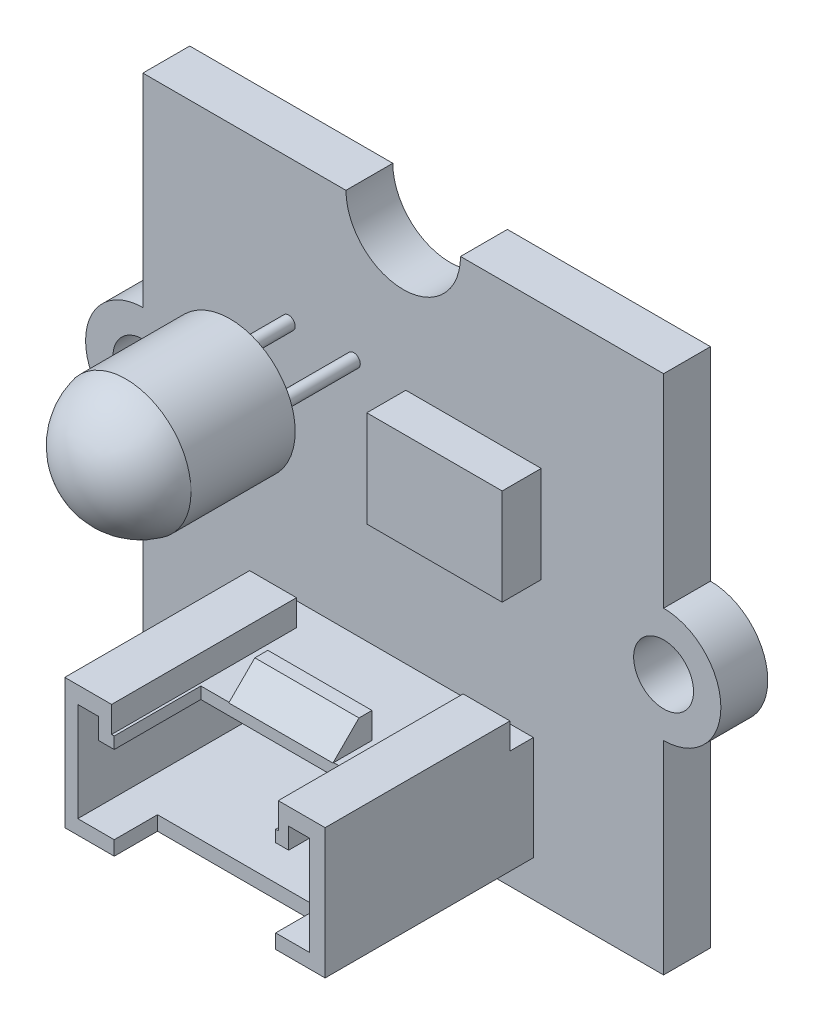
ISO-10303-21;
HEADER;
FILE_DESCRIPTION(('STEP AP214'),'2;1');
FILE_NAME('part.step','',(''),(''),'','','');
FILE_SCHEMA(('AUTOMOTIVE_DESIGN { 1 0 10303 214 1 1 1 1 }'));
ENDSEC;
DATA;
#1=APPLICATION_CONTEXT('core data for automotive mechanical design processes');
#2=APPLICATION_PROTOCOL_DEFINITION('international standard','automotive_design',2000,#1);
#3=PRODUCT_CONTEXT('',#1,'mechanical');
#4=PRODUCT('Part','Part','',(#3));
#5=PRODUCT_RELATED_PRODUCT_CATEGORY('part','',(#4));
#6=PRODUCT_DEFINITION_FORMATION('','',#4);
#7=PRODUCT_DEFINITION_CONTEXT('part definition',#1,'design');
#8=PRODUCT_DEFINITION('design','',#6,#7);
#9=PRODUCT_DEFINITION_SHAPE('','',#8);
#10=(LENGTH_UNIT() NAMED_UNIT(*) SI_UNIT(.MILLI.,.METRE.));
#11=(NAMED_UNIT(*) PLANE_ANGLE_UNIT() SI_UNIT($,.RADIAN.));
#12=(NAMED_UNIT(*) SI_UNIT($,.STERADIAN.) SOLID_ANGLE_UNIT());
#13=UNCERTAINTY_MEASURE_WITH_UNIT(LENGTH_MEASURE(1.E-05),#10,'distance_accuracy_value','');
#14=(GEOMETRIC_REPRESENTATION_CONTEXT(3) GLOBAL_UNCERTAINTY_ASSIGNED_CONTEXT((#13)) GLOBAL_UNIT_ASSIGNED_CONTEXT((#10,
#11,#12)) REPRESENTATION_CONTEXT('',''));
#15=CARTESIAN_POINT('',(0.,0.,0.));
#16=DIRECTION('',(0.,0.,1.));
#17=DIRECTION('',(1.,0.,0.));
#18=AXIS2_PLACEMENT_3D('',#15,#16,#17);
#19=CARTESIAN_POINT('',(-2.74464533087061,10.9929078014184,1.8));
#20=DIRECTION('',(0.,0.,1.));
#21=DIRECTION('',(1.,0.,0.));
#22=AXIS2_PLACEMENT_3D('',#19,#20,#21);
#23=PLANE('',#22);
#24=CARTESIAN_POINT('',(-4.64464533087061,5.49290780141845,1.8));
#25=DIRECTION('',(0.,0.,1.));
#26=DIRECTION('',(1.,0.,0.));
#27=AXIS2_PLACEMENT_3D('',#24,#25,#26);
#28=CIRCLE('',#27,0.25);
#29=CARTESIAN_POINT('',(-4.39464533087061,5.49290780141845,1.8));
#30=VERTEX_POINT('',#29);
#31=EDGE_CURVE('E994',#30,#30,#28,.T.);
#32=ORIENTED_EDGE('',*,*,#31,.F.);
#33=EDGE_LOOP('',(#32));
#34=FACE_BOUND('',#33,.T.);
#35=CARTESIAN_POINT('',(-7.14464533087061,5.49290780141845,1.8));
#36=DIRECTION('',(0.,0.,1.));
#37=DIRECTION('',(1.,0.,0.));
#38=AXIS2_PLACEMENT_3D('',#35,#36,#37);
#39=CIRCLE('',#38,0.25);
#40=CARTESIAN_POINT('',(-6.89464533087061,5.49290780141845,1.8));
#41=VERTEX_POINT('',#40);
#42=EDGE_CURVE('E988',#41,#41,#39,.T.);
#43=ORIENTED_EDGE('',*,*,#42,.F.);
#44=EDGE_LOOP('',(#43));
#45=FACE_BOUND('',#44,.T.);
#46=DIRECTION('',(0.,-1.,0.));
#47=VECTOR('',#46,1.);
#48=CARTESIAN_POINT('',(-7.74464533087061,-2.60709219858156,1.8));
#49=LINE('',#48,#47);
#50=CARTESIAN_POINT('',(-7.74464533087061,-3.60709219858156,1.8));
#51=VERTEX_POINT('',#50);
#52=CARTESIAN_POINT('',(-7.74464533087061,-7.60709219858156,1.8));
#53=VERTEX_POINT('',#52);
#54=EDGE_CURVE('E547',#51,#53,#49,.T.);
#55=ORIENTED_EDGE('',*,*,#54,.F.);
#56=DIRECTION('',(-1.,0.,0.));
#57=VECTOR('',#56,1.);
#58=CARTESIAN_POINT('',(-7.74464533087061,-3.60709219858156,1.8));
#59=LINE('',#58,#57);
#60=CARTESIAN_POINT('',(2.25535466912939,-3.60709219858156,1.8));
#61=VERTEX_POINT('',#60);
#62=EDGE_CURVE('E533',#61,#51,#59,.T.);
#63=ORIENTED_EDGE('',*,*,#62,.F.);
#64=DIRECTION('',(0.,1.,0.));
#65=VECTOR('',#64,1.);
#66=CARTESIAN_POINT('',(2.25535466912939,-2.60709219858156,1.8));
#67=LINE('',#66,#65);
#68=CARTESIAN_POINT('',(2.25535466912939,-7.60709219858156,1.8));
#69=VERTEX_POINT('',#68);
#70=EDGE_CURVE('E562',#69,#61,#67,.T.);
#71=ORIENTED_EDGE('',*,*,#70,.F.);
#72=DIRECTION('',(1.,0.,0.));
#73=VECTOR('',#72,1.);
#74=CARTESIAN_POINT('',(-7.74464533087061,-7.60709219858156,1.8));
#75=LINE('',#74,#73);
#76=CARTESIAN_POINT('',(-0.983253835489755,-7.60709219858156,1.8));
#77=VERTEX_POINT('',#76);
#78=EDGE_CURVE('E578',#77,#69,#75,.T.);
#79=ORIENTED_EDGE('',*,*,#78,.F.);
#80=CARTESIAN_POINT('',(-2.74464533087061,-9.00709219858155,1.8));
#81=DIRECTION('',(0.,0.,-1.));
#82=DIRECTION('',(1.,0.,0.));
#83=AXIS2_PLACEMENT_3D('',#80,#81,#82);
#84=CIRCLE('',#83,2.25);
#85=CARTESIAN_POINT('',(-0.494645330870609,-9.00709219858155,1.8));
#86=VERTEX_POINT('',#85);
#87=EDGE_CURVE('E617',#77,#86,#84,.T.);
#88=ORIENTED_EDGE('',*,*,#87,.T.);
#89=DIRECTION('',(1.,0.,0.));
#90=VECTOR('',#89,1.);
#91=CARTESIAN_POINT('',(-0.494645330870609,-9.00709219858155,1.8));
#92=LINE('',#91,#90);
#93=CARTESIAN_POINT('',(7.25535466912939,-9.00709219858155,1.8));
#94=VERTEX_POINT('',#93);
#95=EDGE_CURVE('E621',#86,#94,#92,.T.);
#96=ORIENTED_EDGE('',*,*,#95,.T.);
#97=DIRECTION('',(0.,1.,0.));
#98=VECTOR('',#97,1.);
#99=CARTESIAN_POINT('',(7.25535466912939,-1.20709219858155,1.8));
#100=LINE('',#99,#98);
#101=CARTESIAN_POINT('',(7.25535466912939,-1.20709219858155,1.8));
#102=VERTEX_POINT('',#101);
#103=EDGE_CURVE('E624',#94,#102,#100,.T.);
#104=ORIENTED_EDGE('',*,*,#103,.T.);
#105=CARTESIAN_POINT('',(7.25535466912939,0.992907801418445,1.8));
#106=DIRECTION('',(0.,0.,1.));
#107=DIRECTION('',(1.,0.,0.));
#108=AXIS2_PLACEMENT_3D('',#105,#106,#107);
#109=CIRCLE('',#108,2.2);
#110=CARTESIAN_POINT('',(7.25535466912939,3.19290780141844,1.8));
#111=VERTEX_POINT('',#110);
#112=EDGE_CURVE('E626',#102,#111,#109,.T.);
#113=ORIENTED_EDGE('',*,*,#112,.T.);
#114=DIRECTION('',(0.,1.,0.));
#115=VECTOR('',#114,1.);
#116=CARTESIAN_POINT('',(7.25535466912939,10.9929078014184,1.8));
#117=LINE('',#116,#115);
#118=CARTESIAN_POINT('',(7.25535466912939,10.9929078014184,1.8));
#119=VERTEX_POINT('',#118);
#120=EDGE_CURVE('E628',#111,#119,#117,.T.);
#121=ORIENTED_EDGE('',*,*,#120,.T.);
#122=DIRECTION('',(-1.,0.,0.));
#123=VECTOR('',#122,1.);
#124=CARTESIAN_POINT('',(-0.544645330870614,10.9929078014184,1.8));
#125=LINE('',#124,#123);
#126=CARTESIAN_POINT('',(-0.544645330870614,10.9929078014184,1.8));
#127=VERTEX_POINT('',#126);
#128=EDGE_CURVE('E630',#119,#127,#125,.T.);
#129=ORIENTED_EDGE('',*,*,#128,.T.);
#130=CARTESIAN_POINT('',(-2.74464533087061,10.9929078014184,1.8));
#131=DIRECTION('',(0.,0.,-1.));
#132=DIRECTION('',(1.,0.,0.));
#133=AXIS2_PLACEMENT_3D('',#130,#131,#132);
#134=CIRCLE('',#133,2.2);
#135=CARTESIAN_POINT('',(-4.94464533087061,10.9929078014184,1.8));
#136=VERTEX_POINT('',#135);
#137=EDGE_CURVE('E632',#127,#136,#134,.T.);
#138=ORIENTED_EDGE('',*,*,#137,.T.);
#139=DIRECTION('',(-1.,0.,0.));
#140=VECTOR('',#139,1.);
#141=CARTESIAN_POINT('',(-12.7446453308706,10.9929078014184,1.8));
#142=LINE('',#141,#140);
#143=CARTESIAN_POINT('',(-12.7446453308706,10.9929078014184,1.8));
#144=VERTEX_POINT('',#143);
#145=EDGE_CURVE('E605',#136,#144,#142,.T.);
#146=ORIENTED_EDGE('',*,*,#145,.T.);
#147=DIRECTION('',(0.,-1.,0.));
#148=VECTOR('',#147,1.);
#149=CARTESIAN_POINT('',(-12.7446453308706,10.9929078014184,1.8));
#150=LINE('',#149,#148);
#151=CARTESIAN_POINT('',(-12.7446453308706,3.19290780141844,1.8));
#152=VERTEX_POINT('',#151);
#153=EDGE_CURVE('E608',#144,#152,#150,.T.);
#154=ORIENTED_EDGE('',*,*,#153,.T.);
#155=CARTESIAN_POINT('',(-12.7446453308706,0.992907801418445,1.8));
#156=DIRECTION('',(0.,0.,1.));
#157=DIRECTION('',(1.,0.,0.));
#158=AXIS2_PLACEMENT_3D('',#155,#156,#157);
#159=CIRCLE('',#158,2.2);
#160=CARTESIAN_POINT('',(-12.7446453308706,-1.20709219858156,1.8));
#161=VERTEX_POINT('',#160);
#162=EDGE_CURVE('E611',#152,#161,#159,.T.);
#163=ORIENTED_EDGE('',*,*,#162,.T.);
#164=DIRECTION('',(0.,-1.,0.));
#165=VECTOR('',#164,1.);
#166=CARTESIAN_POINT('',(-12.7446453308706,-1.20709219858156,1.8));
#167=LINE('',#166,#165);
#168=CARTESIAN_POINT('',(-12.7446453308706,-9.00709219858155,1.8));
#169=VERTEX_POINT('',#168);
#170=EDGE_CURVE('E613',#161,#169,#167,.T.);
#171=ORIENTED_EDGE('',*,*,#170,.T.);
#172=DIRECTION('',(1.,0.,0.));
#173=VECTOR('',#172,1.);
#174=CARTESIAN_POINT('',(-12.7446453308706,-9.00709219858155,1.8));
#175=LINE('',#174,#173);
#176=CARTESIAN_POINT('',(-4.99464533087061,-9.00709219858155,1.8));
#177=VERTEX_POINT('',#176);
#178=EDGE_CURVE('E615',#169,#177,#175,.T.);
#179=ORIENTED_EDGE('',*,*,#178,.T.);
#180=CARTESIAN_POINT('',(-4.50603682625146,-7.60709219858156,1.8));
#181=VERTEX_POINT('',#180);
#182=EDGE_CURVE('E618',#177,#181,#84,.T.);
#183=ORIENTED_EDGE('',*,*,#182,.T.);
#184=EDGE_CURVE('E575',#53,#181,#75,.T.);
#185=ORIENTED_EDGE('',*,*,#184,.F.);
#186=EDGE_LOOP('',(#55,#63,#71,#79,#88,#96,#104,#113,#121,#129,#138,#146,#154,#163,#171,#179,
#183,#185));
#187=FACE_BOUND('',#186,.T.);
#188=CARTESIAN_POINT('',(-12.7446453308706,0.992907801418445,1.8));
#189=DIRECTION('',(0.,0.,1.));
#190=DIRECTION('',(1.,0.,0.));
#191=AXIS2_PLACEMENT_3D('',#188,#189,#190);
#192=CIRCLE('',#191,1.15);
#193=CARTESIAN_POINT('',(-11.5946453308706,0.992907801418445,1.8));
#194=VERTEX_POINT('',#193);
#195=EDGE_CURVE('E599',#194,#194,#192,.T.);
#196=ORIENTED_EDGE('',*,*,#195,.F.);
#197=EDGE_LOOP('',(#196));
#198=FACE_BOUND('',#197,.T.);
#199=CARTESIAN_POINT('',(7.25535466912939,0.992907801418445,1.8));
#200=DIRECTION('',(0.,0.,1.));
#201=DIRECTION('',(1.,0.,0.));
#202=AXIS2_PLACEMENT_3D('',#199,#200,#201);
#203=CIRCLE('',#202,1.15);
#204=CARTESIAN_POINT('',(8.40535466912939,0.992907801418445,1.8));
#205=VERTEX_POINT('',#204);
#206=EDGE_CURVE('E593',#205,#205,#203,.T.);
#207=ORIENTED_EDGE('',*,*,#206,.F.);
#208=EDGE_LOOP('',(#207));
#209=FACE_BOUND('',#208,.T.);
#210=DIRECTION('',(1.,0.,0.));
#211=VECTOR('',#210,1.);
#212=CARTESIAN_POINT('',(-2.64464533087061,1.79290780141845,1.8));
#213=LINE('',#212,#211);
#214=CARTESIAN_POINT('',(-2.64464533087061,1.79290780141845,1.8));
#215=VERTEX_POINT('',#214);
#216=CARTESIAN_POINT('',(2.55535466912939,1.79290780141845,1.8));
#217=VERTEX_POINT('',#216);
#218=EDGE_CURVE('E975',#215,#217,#213,.T.);
#219=ORIENTED_EDGE('',*,*,#218,.F.);
#220=DIRECTION('',(0.,-1.,0.));
#221=VECTOR('',#220,1.);
#222=CARTESIAN_POINT('',(-2.64464533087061,5.49290780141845,1.8));
#223=LINE('',#222,#221);
#224=CARTESIAN_POINT('',(-2.64464533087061,5.49290780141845,1.8));
#225=VERTEX_POINT('',#224);
#226=EDGE_CURVE('E363',#225,#215,#223,.T.);
#227=ORIENTED_EDGE('',*,*,#226,.F.);
#228=DIRECTION('',(-1.,0.,0.));
#229=VECTOR('',#228,1.);
#230=CARTESIAN_POINT('',(-2.64464533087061,5.49290780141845,1.8));
#231=LINE('',#230,#229);
#232=CARTESIAN_POINT('',(2.55535466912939,5.49290780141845,1.8));
#233=VERTEX_POINT('',#232);
#234=EDGE_CURVE('E359',#233,#225,#231,.T.);
#235=ORIENTED_EDGE('',*,*,#234,.F.);
#236=DIRECTION('',(0.,1.,0.));
#237=VECTOR('',#236,1.);
#238=CARTESIAN_POINT('',(2.55535466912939,5.49290780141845,1.8));
#239=LINE('',#238,#237);
#240=EDGE_CURVE('E977',#217,#233,#239,.T.);
#241=ORIENTED_EDGE('',*,*,#240,.F.);
#242=EDGE_LOOP('',(#219,#227,#235,#241));
#243=FACE_BOUND('',#242,.T.);
#244=ADVANCED_FACE('F34',(#34,#45,#187,#198,#209,#243),#23,.T.);
#245=CARTESIAN_POINT('',(-5.84464533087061,-4.60709219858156,9.8));
#246=DIRECTION('',(-1.,0.,0.));
#247=DIRECTION('',(0.,0.,1.));
#248=AXIS2_PLACEMENT_3D('',#245,#246,#247);
#249=PLANE('',#248);
#250=DIRECTION('',(0.,1.,0.));
#251=VECTOR('',#250,1.);
#252=CARTESIAN_POINT('',(-5.84464533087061,-4.60709219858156,9.8));
#253=LINE('',#252,#251);
#254=CARTESIAN_POINT('',(-5.84464533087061,-4.05709219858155,9.8));
#255=VERTEX_POINT('',#254);
#256=CARTESIAN_POINT('',(-5.84464533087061,-3.60709219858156,9.8));
#257=VERTEX_POINT('',#256);
#258=EDGE_CURVE('E469',#255,#257,#253,.T.);
#259=ORIENTED_EDGE('',*,*,#258,.F.);
#260=DIRECTION('',(0.,0.,-1.));
#261=VECTOR('',#260,1.);
#262=CARTESIAN_POINT('',(-5.84464533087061,-4.05709219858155,9.8));
#263=LINE('',#262,#261);
#264=CARTESIAN_POINT('',(-5.84464533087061,-4.05709219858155,6.47353420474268));
#265=VERTEX_POINT('',#264);
#266=EDGE_CURVE('E441',#255,#265,#263,.T.);
#267=ORIENTED_EDGE('',*,*,#266,.T.);
#268=DIRECTION('',(0.,1.,0.));
#269=VECTOR('',#268,1.);
#270=CARTESIAN_POINT('',(-5.84464533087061,-4.60709219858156,6.47353420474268));
#271=LINE('',#270,#269);
#272=CARTESIAN_POINT('',(-5.84464533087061,-3.60709219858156,6.47353420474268));
#273=VERTEX_POINT('',#272);
#274=EDGE_CURVE('E471',#265,#273,#271,.T.);
#275=ORIENTED_EDGE('',*,*,#274,.T.);
#276=DIRECTION('',(0.,0.,1.));
#277=VECTOR('',#276,1.);
#278=CARTESIAN_POINT('',(-5.84464533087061,-3.60709219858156,9.8));
#279=LINE('',#278,#277);
#280=EDGE_CURVE('E459',#273,#257,#279,.T.);
#281=ORIENTED_EDGE('',*,*,#280,.T.);
#282=EDGE_LOOP('',(#259,#267,#275,#281));
#283=FACE_BOUND('',#282,.T.);
#284=ADVANCED_FACE('F782',(#283),#249,.F.);
#285=CARTESIAN_POINT('',(0.355354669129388,-4.60709219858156,9.8));
#286=DIRECTION('',(1.,0.,0.));
#287=DIRECTION('',(0.,0.,-1.));
#288=AXIS2_PLACEMENT_3D('',#285,#286,#287);
#289=PLANE('',#288);
#290=DIRECTION('',(0.,1.,0.));
#291=VECTOR('',#290,1.);
#292=CARTESIAN_POINT('',(0.355354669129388,-4.60709219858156,6.47353420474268));
#293=LINE('',#292,#291);
#294=CARTESIAN_POINT('',(0.355354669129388,-4.05709219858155,6.47353420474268));
#295=VERTEX_POINT('',#294);
#296=CARTESIAN_POINT('',(0.355354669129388,-3.60709219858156,6.47353420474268));
#297=VERTEX_POINT('',#296);
#298=EDGE_CURVE('E474',#295,#297,#293,.T.);
#299=ORIENTED_EDGE('',*,*,#298,.F.);
#300=DIRECTION('',(0.,0.,1.));
#301=VECTOR('',#300,1.);
#302=CARTESIAN_POINT('',(0.355354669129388,-4.05709219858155,9.8));
#303=LINE('',#302,#301);
#304=CARTESIAN_POINT('',(0.355354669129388,-4.05709219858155,9.8));
#305=VERTEX_POINT('',#304);
#306=EDGE_CURVE('E11',#295,#305,#303,.T.);
#307=ORIENTED_EDGE('',*,*,#306,.T.);
#308=DIRECTION('',(0.,1.,0.));
#309=VECTOR('',#308,1.);
#310=CARTESIAN_POINT('',(0.355354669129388,-4.60709219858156,9.8));
#311=LINE('',#310,#309);
#312=CARTESIAN_POINT('',(0.355354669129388,-3.60709219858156,9.8));
#313=VERTEX_POINT('',#312);
#314=EDGE_CURVE('E479',#305,#313,#311,.T.);
#315=ORIENTED_EDGE('',*,*,#314,.T.);
#316=DIRECTION('',(0.,0.,-1.));
#317=VECTOR('',#316,1.);
#318=CARTESIAN_POINT('',(0.355354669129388,-3.60709219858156,9.8));
#319=LINE('',#318,#317);
#320=EDGE_CURVE('E462',#313,#297,#319,.T.);
#321=ORIENTED_EDGE('',*,*,#320,.T.);
#322=EDGE_LOOP('',(#299,#307,#315,#321));
#323=FACE_BOUND('',#322,.T.);
#324=ADVANCED_FACE('F819',(#323),#289,.F.);
#325=CARTESIAN_POINT('',(0.,0.,9.8));
#326=DIRECTION('',(0.,0.,1.));
#327=DIRECTION('',(1.,0.,0.));
#328=AXIS2_PLACEMENT_3D('',#325,#326,#327);
#329=PLANE('',#328);
#330=DIRECTION('',(-1.,0.,0.));
#331=VECTOR('',#330,1.);
#332=CARTESIAN_POINT('',(-6.44464533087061,-4.05709219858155,9.8));
#333=LINE('',#332,#331);
#334=CARTESIAN_POINT('',(-6.44464533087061,-4.05709219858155,9.8));
#335=VERTEX_POINT('',#334);
#336=EDGE_CURVE('E406',#255,#335,#333,.T.);
#337=ORIENTED_EDGE('',*,*,#336,.F.);
#338=ORIENTED_EDGE('',*,*,#258,.T.);
#339=DIRECTION('',(1.,0.,0.));
#340=VECTOR('',#339,1.);
#341=CARTESIAN_POINT('',(0.455354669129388,-3.60709219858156,9.8));
#342=LINE('',#341,#340);
#343=CARTESIAN_POINT('',(-5.94464533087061,-3.60709219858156,9.8));
#344=VERTEX_POINT('',#343);
#345=EDGE_CURVE('E522',#344,#257,#342,.T.);
#346=ORIENTED_EDGE('',*,*,#345,.F.);
#347=DIRECTION('',(0.,1.,0.));
#348=VECTOR('',#347,1.);
#349=CARTESIAN_POINT('',(-5.94464533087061,-3.60709219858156,9.8));
#350=LINE('',#349,#348);
#351=CARTESIAN_POINT('',(-5.94464533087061,-2.60709219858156,9.8));
#352=VERTEX_POINT('',#351);
#353=EDGE_CURVE('E552',#344,#352,#350,.T.);
#354=ORIENTED_EDGE('',*,*,#353,.T.);
#355=DIRECTION('',(-1.,0.,0.));
#356=VECTOR('',#355,1.);
#357=CARTESIAN_POINT('',(-7.74464533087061,-2.60709219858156,9.8));
#358=LINE('',#357,#356);
#359=CARTESIAN_POINT('',(-7.74464533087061,-2.60709219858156,9.8));
#360=VERTEX_POINT('',#359);
#361=EDGE_CURVE('E568',#352,#360,#358,.T.);
#362=ORIENTED_EDGE('',*,*,#361,.T.);
#363=DIRECTION('',(0.,-1.,0.));
#364=VECTOR('',#363,1.);
#365=CARTESIAN_POINT('',(-7.74464533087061,-2.60709219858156,9.8));
#366=LINE('',#365,#364);
#367=CARTESIAN_POINT('',(-7.74464533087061,-7.60709219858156,9.8));
#368=VERTEX_POINT('',#367);
#369=EDGE_CURVE('E558',#360,#368,#366,.T.);
#370=ORIENTED_EDGE('',*,*,#369,.T.);
#371=DIRECTION('',(1.,0.,0.));
#372=VECTOR('',#371,1.);
#373=CARTESIAN_POINT('',(-7.74464533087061,-7.60709219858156,9.8));
#374=LINE('',#373,#372);
#375=CARTESIAN_POINT('',(-5.84464533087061,-7.60709219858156,9.8));
#376=VERTEX_POINT('',#375);
#377=EDGE_CURVE('E563',#368,#376,#374,.T.);
#378=ORIENTED_EDGE('',*,*,#377,.T.);
#379=CARTESIAN_POINT('',(-5.84464533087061,-7.05709219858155,9.8));
#380=VERTEX_POINT('',#379);
#381=EDGE_CURVE('E480',#376,#380,#253,.T.);
#382=ORIENTED_EDGE('',*,*,#381,.T.);
#383=DIRECTION('',(1.,0.,0.));
#384=VECTOR('',#383,1.);
#385=CARTESIAN_POINT('',(-7.24464533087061,-7.05709219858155,9.8));
#386=LINE('',#385,#384);
#387=CARTESIAN_POINT('',(-7.24464533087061,-7.05709219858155,9.8));
#388=VERTEX_POINT('',#387);
#389=EDGE_CURVE('E367',#388,#380,#386,.T.);
#390=ORIENTED_EDGE('',*,*,#389,.F.);
#391=DIRECTION('',(0.,-1.,0.));
#392=VECTOR('',#391,1.);
#393=CARTESIAN_POINT('',(-7.24464533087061,-4.05709219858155,9.8));
#394=LINE('',#393,#392);
#395=CARTESIAN_POINT('',(-7.24464533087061,-3.25709219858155,9.8));
#396=VERTEX_POINT('',#395);
#397=EDGE_CURVE('E376',#396,#388,#394,.T.);
#398=ORIENTED_EDGE('',*,*,#397,.F.);
#399=DIRECTION('',(-1.,0.,0.));
#400=VECTOR('',#399,1.);
#401=CARTESIAN_POINT('',(-7.24464533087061,-3.25709219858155,9.8));
#402=LINE('',#401,#400);
#403=CARTESIAN_POINT('',(-6.44464533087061,-3.25709219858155,9.8));
#404=VERTEX_POINT('',#403);
#405=EDGE_CURVE('E412',#404,#396,#402,.T.);
#406=ORIENTED_EDGE('',*,*,#405,.F.);
#407=DIRECTION('',(0.,1.,0.));
#408=VECTOR('',#407,1.);
#409=CARTESIAN_POINT('',(-6.44464533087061,-3.25709219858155,9.8));
#410=LINE('',#409,#408);
#411=EDGE_CURVE('E409',#335,#404,#410,.T.);
#412=ORIENTED_EDGE('',*,*,#411,.F.);
#413=EDGE_LOOP('',(#337,#338,#346,#354,#362,#370,#378,#382,#390,#398,#406,#412));
#414=FACE_BOUND('',#413,.T.);
#415=ADVANCED_FACE('F711',(#414),#329,.T.);
#416=CARTESIAN_POINT('',(-7.74464533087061,-2.60709219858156,9.8));
#417=DIRECTION('',(0.,-1.,0.));
#418=DIRECTION('',(0.,0.,-1.));
#419=AXIS2_PLACEMENT_3D('',#416,#417,#418);
#420=PLANE('',#419);
#421=DIRECTION('',(0.,0.,-1.));
#422=VECTOR('',#421,1.);
#423=CARTESIAN_POINT('',(2.25535466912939,-2.60709219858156,9.8));
#424=LINE('',#423,#422);
#425=CARTESIAN_POINT('',(2.25535466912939,-2.60709219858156,9.8));
#426=VERTEX_POINT('',#425);
#427=CARTESIAN_POINT('',(2.25535466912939,-2.60709219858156,2.7));
#428=VERTEX_POINT('',#427);
#429=EDGE_CURVE('E583',#426,#428,#424,.T.);
#430=ORIENTED_EDGE('',*,*,#429,.T.);
#431=DIRECTION('',(1.,0.,0.));
#432=VECTOR('',#431,1.);
#433=CARTESIAN_POINT('',(2.25535466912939,-2.60709219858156,2.7));
#434=LINE('',#433,#432);
#435=CARTESIAN_POINT('',(0.455354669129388,-2.60709219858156,2.7));
#436=VERTEX_POINT('',#435);
#437=EDGE_CURVE('E516',#436,#428,#434,.T.);
#438=ORIENTED_EDGE('',*,*,#437,.F.);
#439=DIRECTION('',(0.,0.,-1.));
#440=VECTOR('',#439,1.);
#441=CARTESIAN_POINT('',(0.455354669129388,-2.60709219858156,2.7));
#442=LINE('',#441,#440);
#443=CARTESIAN_POINT('',(0.455354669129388,-2.60709219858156,9.8));
#444=VERTEX_POINT('',#443);
#445=EDGE_CURVE('E540',#444,#436,#442,.T.);
#446=ORIENTED_EDGE('',*,*,#445,.F.);
#447=EDGE_CURVE('E569',#426,#444,#358,.T.);
#448=ORIENTED_EDGE('',*,*,#447,.F.);
#449=EDGE_LOOP('',(#430,#438,#446,#448));
#450=FACE_BOUND('',#449,.T.);
#451=ADVANCED_FACE('F808',(#450),#420,.F.);
#452=CARTESIAN_POINT('',(-2.74464533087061,10.9929078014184,0.));
#453=DIRECTION('',(0.,0.,1.));
#454=DIRECTION('',(1.,0.,0.));
#455=AXIS2_PLACEMENT_3D('',#452,#453,#454);
#456=PLANE('',#455);
#457=DIRECTION('',(-1.,0.,0.));
#458=VECTOR('',#457,1.);
#459=CARTESIAN_POINT('',(-12.7446453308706,10.9929078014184,0.));
#460=LINE('',#459,#458);
#461=CARTESIAN_POINT('',(-4.94464533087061,10.9929078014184,0.));
#462=VERTEX_POINT('',#461);
#463=CARTESIAN_POINT('',(-12.7446453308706,10.9929078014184,0.));
#464=VERTEX_POINT('',#463);
#465=EDGE_CURVE('E602',#462,#464,#460,.T.);
#466=ORIENTED_EDGE('',*,*,#465,.F.);
#467=CARTESIAN_POINT('',(-2.74464533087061,10.9929078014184,0.));
#468=DIRECTION('',(0.,0.,-1.));
#469=DIRECTION('',(1.,0.,0.));
#470=AXIS2_PLACEMENT_3D('',#467,#468,#469);
#471=CIRCLE('',#470,2.2);
#472=CARTESIAN_POINT('',(-0.544645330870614,10.9929078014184,0.));
#473=VERTEX_POINT('',#472);
#474=EDGE_CURVE('E609',#473,#462,#471,.T.);
#475=ORIENTED_EDGE('',*,*,#474,.F.);
#476=DIRECTION('',(-1.,0.,0.));
#477=VECTOR('',#476,1.);
#478=CARTESIAN_POINT('',(-0.544645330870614,10.9929078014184,0.));
#479=LINE('',#478,#477);
#480=CARTESIAN_POINT('',(7.25535466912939,10.9929078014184,0.));
#481=VERTEX_POINT('',#480);
#482=EDGE_CURVE('E655',#481,#473,#479,.T.);
#483=ORIENTED_EDGE('',*,*,#482,.F.);
#484=DIRECTION('',(0.,1.,0.));
#485=VECTOR('',#484,1.);
#486=CARTESIAN_POINT('',(7.25535466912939,10.9929078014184,0.));
#487=LINE('',#486,#485);
#488=CARTESIAN_POINT('',(7.25535466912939,3.19290780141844,0.));
#489=VERTEX_POINT('',#488);
#490=EDGE_CURVE('E653',#489,#481,#487,.T.);
#491=ORIENTED_EDGE('',*,*,#490,.F.);
#492=CARTESIAN_POINT('',(7.25535466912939,0.992907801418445,0.));
#493=DIRECTION('',(0.,0.,1.));
#494=DIRECTION('',(1.,0.,0.));
#495=AXIS2_PLACEMENT_3D('',#492,#493,#494);
#496=CIRCLE('',#495,2.2);
#497=CARTESIAN_POINT('',(7.25535466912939,-1.20709219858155,0.));
#498=VERTEX_POINT('',#497);
#499=EDGE_CURVE('E651',#498,#489,#496,.T.);
#500=ORIENTED_EDGE('',*,*,#499,.F.);
#501=DIRECTION('',(0.,1.,0.));
#502=VECTOR('',#501,1.);
#503=CARTESIAN_POINT('',(7.25535466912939,-1.20709219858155,0.));
#504=LINE('',#503,#502);
#505=CARTESIAN_POINT('',(7.25535466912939,-9.00709219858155,0.));
#506=VERTEX_POINT('',#505);
#507=EDGE_CURVE('E649',#506,#498,#504,.T.);
#508=ORIENTED_EDGE('',*,*,#507,.F.);
#509=DIRECTION('',(1.,0.,0.));
#510=VECTOR('',#509,1.);
#511=CARTESIAN_POINT('',(-0.494645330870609,-9.00709219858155,0.));
#512=LINE('',#511,#510);
#513=CARTESIAN_POINT('',(-0.494645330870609,-9.00709219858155,0.));
#514=VERTEX_POINT('',#513);
#515=EDGE_CURVE('E647',#514,#506,#512,.T.);
#516=ORIENTED_EDGE('',*,*,#515,.F.);
#517=CARTESIAN_POINT('',(-2.74464533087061,-9.00709219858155,0.));
#518=DIRECTION('',(0.,0.,-1.));
#519=DIRECTION('',(1.,0.,0.));
#520=AXIS2_PLACEMENT_3D('',#517,#518,#519);
#521=CIRCLE('',#520,2.25);
#522=CARTESIAN_POINT('',(-4.99464533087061,-9.00709219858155,0.));
#523=VERTEX_POINT('',#522);
#524=EDGE_CURVE('E645',#523,#514,#521,.T.);
#525=ORIENTED_EDGE('',*,*,#524,.F.);
#526=DIRECTION('',(1.,0.,0.));
#527=VECTOR('',#526,1.);
#528=CARTESIAN_POINT('',(-12.7446453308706,-9.00709219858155,0.));
#529=LINE('',#528,#527);
#530=CARTESIAN_POINT('',(-12.7446453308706,-9.00709219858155,0.));
#531=VERTEX_POINT('',#530);
#532=EDGE_CURVE('E643',#531,#523,#529,.T.);
#533=ORIENTED_EDGE('',*,*,#532,.F.);
#534=DIRECTION('',(0.,-1.,0.));
#535=VECTOR('',#534,1.);
#536=CARTESIAN_POINT('',(-12.7446453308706,-1.20709219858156,0.));
#537=LINE('',#536,#535);
#538=CARTESIAN_POINT('',(-12.7446453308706,-1.20709219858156,0.));
#539=VERTEX_POINT('',#538);
#540=EDGE_CURVE('E641',#539,#531,#537,.T.);
#541=ORIENTED_EDGE('',*,*,#540,.F.);
#542=CARTESIAN_POINT('',(-12.7446453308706,0.992907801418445,0.));
#543=DIRECTION('',(0.,0.,1.));
#544=DIRECTION('',(1.,0.,0.));
#545=AXIS2_PLACEMENT_3D('',#542,#543,#544);
#546=CIRCLE('',#545,2.2);
#547=CARTESIAN_POINT('',(-12.7446453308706,3.19290780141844,0.));
#548=VERTEX_POINT('',#547);
#549=EDGE_CURVE('E639',#548,#539,#546,.T.);
#550=ORIENTED_EDGE('',*,*,#549,.F.);
#551=DIRECTION('',(0.,-1.,0.));
#552=VECTOR('',#551,1.);
#553=CARTESIAN_POINT('',(-12.7446453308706,10.9929078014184,0.));
#554=LINE('',#553,#552);
#555=EDGE_CURVE('E637',#464,#548,#554,.T.);
#556=ORIENTED_EDGE('',*,*,#555,.F.);
#557=EDGE_LOOP('',(#466,#475,#483,#491,#500,#508,#516,#525,#533,#541,#550,#556));
#558=FACE_BOUND('',#557,.T.);
#559=CARTESIAN_POINT('',(-12.7446453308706,0.992907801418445,0.));
#560=DIRECTION('',(0.,0.,1.));
#561=DIRECTION('',(1.,0.,0.));
#562=AXIS2_PLACEMENT_3D('',#559,#560,#561);
#563=CIRCLE('',#562,1.15);
#564=CARTESIAN_POINT('',(-11.5946453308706,0.992907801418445,0.));
#565=VERTEX_POINT('',#564);
#566=EDGE_CURVE('E596',#565,#565,#563,.T.);
#567=ORIENTED_EDGE('',*,*,#566,.T.);
#568=EDGE_LOOP('',(#567));
#569=FACE_BOUND('',#568,.T.);
#570=CARTESIAN_POINT('',(7.25535466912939,0.992907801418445,0.));
#571=DIRECTION('',(0.,0.,1.));
#572=DIRECTION('',(1.,0.,0.));
#573=AXIS2_PLACEMENT_3D('',#570,#571,#572);
#574=CIRCLE('',#573,1.15);
#575=CARTESIAN_POINT('',(8.40535466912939,0.992907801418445,0.));
#576=VERTEX_POINT('',#575);
#577=EDGE_CURVE('E592',#576,#576,#574,.T.);
#578=ORIENTED_EDGE('',*,*,#577,.T.);
#579=EDGE_LOOP('',(#578));
#580=FACE_BOUND('',#579,.T.);
#581=ADVANCED_FACE('F846',(#558,#569,#580),#456,.F.);
#582=CARTESIAN_POINT('',(-12.7446453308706,10.9929078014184,1.8));
#583=DIRECTION('',(0.,-1.,0.));
#584=DIRECTION('',(0.,0.,-1.));
#585=AXIS2_PLACEMENT_3D('',#582,#583,#584);
#586=PLANE('',#585);
#587=ORIENTED_EDGE('',*,*,#465,.T.);
#588=DIRECTION('',(0.,0.,-1.));
#589=VECTOR('',#588,1.);
#590=CARTESIAN_POINT('',(-12.7446453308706,10.9929078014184,1.8));
#591=LINE('',#590,#589);
#592=EDGE_CURVE('E690',#144,#464,#591,.T.);
#593=ORIENTED_EDGE('',*,*,#592,.F.);
#594=ORIENTED_EDGE('',*,*,#145,.F.);
#595=DIRECTION('',(0.,0.,-1.));
#596=VECTOR('',#595,1.);
#597=CARTESIAN_POINT('',(-4.94464533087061,10.9929078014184,1.8));
#598=LINE('',#597,#596);
#599=EDGE_CURVE('E634',#136,#462,#598,.T.);
#600=ORIENTED_EDGE('',*,*,#599,.T.);
#601=EDGE_LOOP('',(#587,#593,#594,#600));
#602=FACE_BOUND('',#601,.T.);
#603=ADVANCED_FACE('F849',(#602),#586,.F.);
#604=CARTESIAN_POINT('',(-12.7446453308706,10.9929078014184,1.8));
#605=DIRECTION('',(1.,0.,0.));
#606=DIRECTION('',(0.,1.,0.));
#607=AXIS2_PLACEMENT_3D('',#604,#605,#606);
#608=PLANE('',#607);
#609=ORIENTED_EDGE('',*,*,#555,.T.);
#610=DIRECTION('',(0.,0.,-1.));
#611=VECTOR('',#610,1.);
#612=CARTESIAN_POINT('',(-12.7446453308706,3.19290780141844,1.8));
#613=LINE('',#612,#611);
#614=EDGE_CURVE('E687',#152,#548,#613,.T.);
#615=ORIENTED_EDGE('',*,*,#614,.F.);
#616=ORIENTED_EDGE('',*,*,#153,.F.);
#617=ORIENTED_EDGE('',*,*,#592,.T.);
#618=EDGE_LOOP('',(#609,#615,#616,#617));
#619=FACE_BOUND('',#618,.T.);
#620=ADVANCED_FACE('F889',(#619),#608,.F.);
#621=CARTESIAN_POINT('',(-12.7446453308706,0.992907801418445,1.8));
#622=DIRECTION('',(0.,0.,-1.));
#623=DIRECTION('',(-1.,0.,0.));
#624=AXIS2_PLACEMENT_3D('',#621,#622,#623);
#625=CYLINDRICAL_SURFACE('',#624,2.2);
#626=ORIENTED_EDGE('',*,*,#549,.T.);
#627=DIRECTION('',(0.,0.,-1.));
#628=VECTOR('',#627,1.);
#629=CARTESIAN_POINT('',(-12.7446453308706,-1.20709219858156,1.8));
#630=LINE('',#629,#628);
#631=EDGE_CURVE('E684',#161,#539,#630,.T.);
#632=ORIENTED_EDGE('',*,*,#631,.F.);
#633=ORIENTED_EDGE('',*,*,#162,.F.);
#634=ORIENTED_EDGE('',*,*,#614,.T.);
#635=EDGE_LOOP('',(#626,#632,#633,#634));
#636=FACE_BOUND('',#635,.T.);
#637=ADVANCED_FACE('F885',(#636),#625,.T.);
#638=CARTESIAN_POINT('',(-12.7446453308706,-1.20709219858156,1.8));
#639=DIRECTION('',(1.,0.,0.));
#640=DIRECTION('',(0.,1.,0.));
#641=AXIS2_PLACEMENT_3D('',#638,#639,#640);
#642=PLANE('',#641);
#643=ORIENTED_EDGE('',*,*,#540,.T.);
#644=DIRECTION('',(0.,0.,-1.));
#645=VECTOR('',#644,1.);
#646=CARTESIAN_POINT('',(-12.7446453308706,-9.00709219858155,1.8));
#647=LINE('',#646,#645);
#648=EDGE_CURVE('E681',#169,#531,#647,.T.);
#649=ORIENTED_EDGE('',*,*,#648,.F.);
#650=ORIENTED_EDGE('',*,*,#170,.F.);
#651=ORIENTED_EDGE('',*,*,#631,.T.);
#652=EDGE_LOOP('',(#643,#649,#650,#651));
#653=FACE_BOUND('',#652,.T.);
#654=ADVANCED_FACE('F881',(#653),#642,.F.);
#655=CARTESIAN_POINT('',(-12.7446453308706,-9.00709219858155,1.8));
#656=DIRECTION('',(0.,1.,0.));
#657=DIRECTION('',(0.,0.,1.));
#658=AXIS2_PLACEMENT_3D('',#655,#656,#657);
#659=PLANE('',#658);
#660=ORIENTED_EDGE('',*,*,#532,.T.);
#661=DIRECTION('',(0.,0.,-1.));
#662=VECTOR('',#661,1.);
#663=CARTESIAN_POINT('',(-4.99464533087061,-9.00709219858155,1.8));
#664=LINE('',#663,#662);
#665=EDGE_CURVE('E678',#177,#523,#664,.T.);
#666=ORIENTED_EDGE('',*,*,#665,.F.);
#667=ORIENTED_EDGE('',*,*,#178,.F.);
#668=ORIENTED_EDGE('',*,*,#648,.T.);
#669=EDGE_LOOP('',(#660,#666,#667,#668));
#670=FACE_BOUND('',#669,.T.);
#671=ADVANCED_FACE('F878',(#670),#659,.F.);
#672=CARTESIAN_POINT('',(-2.74464533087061,-9.00709219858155,1.8));
#673=DIRECTION('',(0.,0.,-1.));
#674=DIRECTION('',(-1.,0.,0.));
#675=AXIS2_PLACEMENT_3D('',#672,#673,#674);
#676=CYLINDRICAL_SURFACE('',#675,2.25);
#677=ORIENTED_EDGE('',*,*,#524,.T.);
#678=DIRECTION('',(0.,0.,-1.));
#679=VECTOR('',#678,1.);
#680=CARTESIAN_POINT('',(-0.494645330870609,-9.00709219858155,1.8));
#681=LINE('',#680,#679);
#682=EDGE_CURVE('E675',#86,#514,#681,.T.);
#683=ORIENTED_EDGE('',*,*,#682,.F.);
#684=ORIENTED_EDGE('',*,*,#87,.F.);
#685=EDGE_CURVE('E622',#181,#77,#84,.T.);
#686=ORIENTED_EDGE('',*,*,#685,.F.);
#687=ORIENTED_EDGE('',*,*,#182,.F.);
#688=ORIENTED_EDGE('',*,*,#665,.T.);
#689=EDGE_LOOP('',(#677,#683,#684,#686,#687,#688));
#690=FACE_BOUND('',#689,.T.);
#691=ADVANCED_FACE('F874',(#690),#676,.F.);
#692=CARTESIAN_POINT('',(-0.494645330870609,-9.00709219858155,1.8));
#693=DIRECTION('',(0.,1.,0.));
#694=DIRECTION('',(0.,0.,1.));
#695=AXIS2_PLACEMENT_3D('',#692,#693,#694);
#696=PLANE('',#695);
#697=ORIENTED_EDGE('',*,*,#515,.T.);
#698=DIRECTION('',(0.,0.,-1.));
#699=VECTOR('',#698,1.);
#700=CARTESIAN_POINT('',(7.25535466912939,-9.00709219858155,1.8));
#701=LINE('',#700,#699);
#702=EDGE_CURVE('E672',#94,#506,#701,.T.);
#703=ORIENTED_EDGE('',*,*,#702,.F.);
#704=ORIENTED_EDGE('',*,*,#95,.F.);
#705=ORIENTED_EDGE('',*,*,#682,.T.);
#706=EDGE_LOOP('',(#697,#703,#704,#705));
#707=FACE_BOUND('',#706,.T.);
#708=ADVANCED_FACE('F870',(#707),#696,.F.);
#709=CARTESIAN_POINT('',(7.25535466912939,-1.20709219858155,1.8));
#710=DIRECTION('',(-1.,0.,0.));
#711=DIRECTION('',(0.,-1.,0.));
#712=AXIS2_PLACEMENT_3D('',#709,#710,#711);
#713=PLANE('',#712);
#714=ORIENTED_EDGE('',*,*,#507,.T.);
#715=DIRECTION('',(0.,0.,-1.));
#716=VECTOR('',#715,1.);
#717=CARTESIAN_POINT('',(7.25535466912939,-1.20709219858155,1.8));
#718=LINE('',#717,#716);
#719=EDGE_CURVE('E669',#102,#498,#718,.T.);
#720=ORIENTED_EDGE('',*,*,#719,.F.);
#721=ORIENTED_EDGE('',*,*,#103,.F.);
#722=ORIENTED_EDGE('',*,*,#702,.T.);
#723=EDGE_LOOP('',(#714,#720,#721,#722));
#724=FACE_BOUND('',#723,.T.);
#725=ADVANCED_FACE('F866',(#724),#713,.F.);
#726=CARTESIAN_POINT('',(7.25535466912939,0.992907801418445,1.8));
#727=DIRECTION('',(0.,0.,-1.));
#728=DIRECTION('',(-1.,0.,0.));
#729=AXIS2_PLACEMENT_3D('',#726,#727,#728);
#730=CYLINDRICAL_SURFACE('',#729,2.2);
#731=ORIENTED_EDGE('',*,*,#499,.T.);
#732=DIRECTION('',(0.,0.,-1.));
#733=VECTOR('',#732,1.);
#734=CARTESIAN_POINT('',(7.25535466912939,3.19290780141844,1.8));
#735=LINE('',#734,#733);
#736=EDGE_CURVE('E666',#111,#489,#735,.T.);
#737=ORIENTED_EDGE('',*,*,#736,.F.);
#738=ORIENTED_EDGE('',*,*,#112,.F.);
#739=ORIENTED_EDGE('',*,*,#719,.T.);
#740=EDGE_LOOP('',(#731,#737,#738,#739));
#741=FACE_BOUND('',#740,.T.);
#742=ADVANCED_FACE('F862',(#741),#730,.T.);
#743=CARTESIAN_POINT('',(7.25535466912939,10.9929078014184,1.8));
#744=DIRECTION('',(-1.,0.,0.));
#745=DIRECTION('',(0.,-1.,0.));
#746=AXIS2_PLACEMENT_3D('',#743,#744,#745);
#747=PLANE('',#746);
#748=ORIENTED_EDGE('',*,*,#490,.T.);
#749=DIRECTION('',(0.,0.,-1.));
#750=VECTOR('',#749,1.);
#751=CARTESIAN_POINT('',(7.25535466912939,10.9929078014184,1.8));
#752=LINE('',#751,#750);
#753=EDGE_CURVE('E663',#119,#481,#752,.T.);
#754=ORIENTED_EDGE('',*,*,#753,.F.);
#755=ORIENTED_EDGE('',*,*,#120,.F.);
#756=ORIENTED_EDGE('',*,*,#736,.T.);
#757=EDGE_LOOP('',(#748,#754,#755,#756));
#758=FACE_BOUND('',#757,.T.);
#759=ADVANCED_FACE('F858',(#758),#747,.F.);
#760=CARTESIAN_POINT('',(-0.544645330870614,10.9929078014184,1.8));
#761=DIRECTION('',(0.,-1.,0.));
#762=DIRECTION('',(0.,0.,-1.));
#763=AXIS2_PLACEMENT_3D('',#760,#761,#762);
#764=PLANE('',#763);
#765=ORIENTED_EDGE('',*,*,#482,.T.);
#766=DIRECTION('',(0.,0.,-1.));
#767=VECTOR('',#766,1.);
#768=CARTESIAN_POINT('',(-0.544645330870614,10.9929078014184,1.8));
#769=LINE('',#768,#767);
#770=EDGE_CURVE('E660',#127,#473,#769,.T.);
#771=ORIENTED_EDGE('',*,*,#770,.F.);
#772=ORIENTED_EDGE('',*,*,#128,.F.);
#773=ORIENTED_EDGE('',*,*,#753,.T.);
#774=EDGE_LOOP('',(#765,#771,#772,#773));
#775=FACE_BOUND('',#774,.T.);
#776=ADVANCED_FACE('F854',(#775),#764,.F.);
#777=CARTESIAN_POINT('',(-2.74464533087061,10.9929078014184,1.8));
#778=DIRECTION('',(0.,0.,-1.));
#779=DIRECTION('',(-1.,0.,0.));
#780=AXIS2_PLACEMENT_3D('',#777,#778,#779);
#781=CYLINDRICAL_SURFACE('',#780,2.2);
#782=ORIENTED_EDGE('',*,*,#474,.T.);
#783=ORIENTED_EDGE('',*,*,#599,.F.);
#784=ORIENTED_EDGE('',*,*,#137,.F.);
#785=ORIENTED_EDGE('',*,*,#770,.T.);
#786=EDGE_LOOP('',(#782,#783,#784,#785));
#787=FACE_BOUND('',#786,.T.);
#788=ADVANCED_FACE('F851',(#787),#781,.F.);
#789=CARTESIAN_POINT('',(-12.7446453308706,0.992907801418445,1.8));
#790=DIRECTION('',(0.,0.,-1.));
#791=DIRECTION('',(-1.,0.,0.));
#792=AXIS2_PLACEMENT_3D('',#789,#790,#791);
#793=CYLINDRICAL_SURFACE('',#792,1.15);
#794=ORIENTED_EDGE('',*,*,#195,.T.);
#795=EDGE_LOOP('',(#794));
#796=FACE_BOUND('',#795,.T.);
#797=ORIENTED_EDGE('',*,*,#566,.F.);
#798=EDGE_LOOP('',(#797));
#799=FACE_BOUND('',#798,.T.);
#800=ADVANCED_FACE('F844',(#796,#799),#793,.F.);
#801=CARTESIAN_POINT('',(7.25535466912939,0.992907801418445,1.8));
#802=DIRECTION('',(0.,0.,-1.));
#803=DIRECTION('',(-1.,0.,0.));
#804=AXIS2_PLACEMENT_3D('',#801,#802,#803);
#805=CYLINDRICAL_SURFACE('',#804,1.15);
#806=ORIENTED_EDGE('',*,*,#206,.T.);
#807=EDGE_LOOP('',(#806));
#808=FACE_BOUND('',#807,.T.);
#809=ORIENTED_EDGE('',*,*,#577,.F.);
#810=EDGE_LOOP('',(#809));
#811=FACE_BOUND('',#810,.T.);
#812=ADVANCED_FACE('F954',(#808,#811),#805,.F.);
#813=CARTESIAN_POINT('',(0.,0.,1.8));
#814=DIRECTION('',(0.,0.,1.));
#815=DIRECTION('',(1.,0.,0.));
#816=AXIS2_PLACEMENT_3D('',#813,#814,#815);
#817=PLANE('',#816);
#818=EDGE_CURVE('E574',#181,#77,#75,.T.);
#819=ORIENTED_EDGE('',*,*,#818,.F.);
#820=ORIENTED_EDGE('',*,*,#685,.T.);
#821=EDGE_LOOP('',(#819,#820));
#822=FACE_BOUND('',#821,.T.);
#823=ADVANCED_FACE('F734',(#822),#817,.F.);
#824=CARTESIAN_POINT('',(-7.74464533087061,-2.60709219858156,9.8));
#825=DIRECTION('',(1.,0.,0.));
#826=DIRECTION('',(0.,1.,0.));
#827=AXIS2_PLACEMENT_3D('',#824,#825,#826);
#828=PLANE('',#827);
#829=DIRECTION('',(0.,0.,-1.));
#830=VECTOR('',#829,1.);
#831=CARTESIAN_POINT('',(-7.74464533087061,-2.60709219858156,9.8));
#832=LINE('',#831,#830);
#833=CARTESIAN_POINT('',(-7.74464533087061,-2.60709219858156,2.7));
#834=VERTEX_POINT('',#833);
#835=EDGE_CURVE('E572',#360,#834,#832,.T.);
#836=ORIENTED_EDGE('',*,*,#835,.T.);
#837=DIRECTION('',(0.,1.,0.));
#838=VECTOR('',#837,1.);
#839=CARTESIAN_POINT('',(-7.74464533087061,-3.60709219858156,2.7));
#840=LINE('',#839,#838);
#841=CARTESIAN_POINT('',(-7.74464533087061,-3.60709219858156,2.7));
#842=VERTEX_POINT('',#841);
#843=EDGE_CURVE('E535',#842,#834,#840,.T.);
#844=ORIENTED_EDGE('',*,*,#843,.F.);
#845=DIRECTION('',(0.,0.,1.));
#846=VECTOR('',#845,1.);
#847=CARTESIAN_POINT('',(-7.74464533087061,-3.60709219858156,1.8));
#848=LINE('',#847,#846);
#849=EDGE_CURVE('E512',#51,#842,#848,.T.);
#850=ORIENTED_EDGE('',*,*,#849,.F.);
#851=ORIENTED_EDGE('',*,*,#54,.T.);
#852=DIRECTION('',(0.,0.,-1.));
#853=VECTOR('',#852,1.);
#854=CARTESIAN_POINT('',(-7.74464533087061,-7.60709219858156,9.8));
#855=LINE('',#854,#853);
#856=EDGE_CURVE('E589',#368,#53,#855,.T.);
#857=ORIENTED_EDGE('',*,*,#856,.F.);
#858=ORIENTED_EDGE('',*,*,#369,.F.);
#859=EDGE_LOOP('',(#836,#844,#850,#851,#857,#858));
#860=FACE_BOUND('',#859,.T.);
#861=ADVANCED_FACE('F718',(#860),#828,.F.);
#862=CARTESIAN_POINT('',(-7.74464533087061,-7.60709219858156,9.8));
#863=DIRECTION('',(0.,1.,0.));
#864=DIRECTION('',(-1.,0.,0.));
#865=AXIS2_PLACEMENT_3D('',#862,#863,#864);
#866=PLANE('',#865);
#867=DIRECTION('',(-1.,0.,0.));
#868=VECTOR('',#867,1.);
#869=CARTESIAN_POINT('',(-7.74464533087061,-7.60709219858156,8.13676710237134));
#870=LINE('',#869,#868);
#871=CARTESIAN_POINT('',(0.355354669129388,-7.60709219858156,8.13676710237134));
#872=VERTEX_POINT('',#871);
#873=CARTESIAN_POINT('',(-5.84464533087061,-7.60709219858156,8.13676710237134));
#874=VERTEX_POINT('',#873);
#875=EDGE_CURVE('E453',#872,#874,#870,.T.);
#876=ORIENTED_EDGE('',*,*,#875,.T.);
#877=DIRECTION('',(0.,0.,1.));
#878=VECTOR('',#877,1.);
#879=CARTESIAN_POINT('',(-5.84464533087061,-7.60709219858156,9.8));
#880=LINE('',#879,#878);
#881=EDGE_CURVE('E456',#874,#376,#880,.T.);
#882=ORIENTED_EDGE('',*,*,#881,.T.);
#883=ORIENTED_EDGE('',*,*,#377,.F.);
#884=ORIENTED_EDGE('',*,*,#856,.T.);
#885=ORIENTED_EDGE('',*,*,#184,.T.);
#886=ORIENTED_EDGE('',*,*,#818,.T.);
#887=ORIENTED_EDGE('',*,*,#78,.T.);
#888=DIRECTION('',(0.,0.,-1.));
#889=VECTOR('',#888,1.);
#890=CARTESIAN_POINT('',(2.25535466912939,-7.60709219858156,9.8));
#891=LINE('',#890,#889);
#892=CARTESIAN_POINT('',(2.25535466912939,-7.60709219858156,9.8));
#893=VERTEX_POINT('',#892);
#894=EDGE_CURVE('E586',#893,#69,#891,.T.);
#895=ORIENTED_EDGE('',*,*,#894,.F.);
#896=CARTESIAN_POINT('',(0.355354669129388,-7.60709219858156,9.8));
#897=VERTEX_POINT('',#896);
#898=EDGE_CURVE('E561',#897,#893,#374,.T.);
#899=ORIENTED_EDGE('',*,*,#898,.F.);
#900=DIRECTION('',(0.,0.,-1.));
#901=VECTOR('',#900,1.);
#902=CARTESIAN_POINT('',(0.355354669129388,-7.60709219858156,9.8));
#903=LINE('',#902,#901);
#904=EDGE_CURVE('E448',#897,#872,#903,.T.);
#905=ORIENTED_EDGE('',*,*,#904,.T.);
#906=EDGE_LOOP('',(#876,#882,#883,#884,#885,#886,#887,#895,#899,#905));
#907=FACE_BOUND('',#906,.T.);
#908=ADVANCED_FACE('F708',(#907),#866,.F.);
#909=CARTESIAN_POINT('',(2.25535466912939,-2.60709219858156,9.8));
#910=DIRECTION('',(-1.,0.,0.));
#911=DIRECTION('',(0.,-1.,0.));
#912=AXIS2_PLACEMENT_3D('',#909,#910,#911);
#913=PLANE('',#912);
#914=DIRECTION('',(0.,0.,-1.));
#915=VECTOR('',#914,1.);
#916=CARTESIAN_POINT('',(2.25535466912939,-3.60709219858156,1.8));
#917=LINE('',#916,#915);
#918=CARTESIAN_POINT('',(2.25535466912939,-3.60709219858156,2.7));
#919=VERTEX_POINT('',#918);
#920=EDGE_CURVE('E531',#919,#61,#917,.T.);
#921=ORIENTED_EDGE('',*,*,#920,.F.);
#922=DIRECTION('',(0.,1.,0.));
#923=VECTOR('',#922,1.);
#924=CARTESIAN_POINT('',(2.25535466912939,-3.60709219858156,2.7));
#925=LINE('',#924,#923);
#926=EDGE_CURVE('E544',#919,#428,#925,.T.);
#927=ORIENTED_EDGE('',*,*,#926,.T.);
#928=ORIENTED_EDGE('',*,*,#429,.F.);
#929=DIRECTION('',(0.,1.,0.));
#930=VECTOR('',#929,1.);
#931=CARTESIAN_POINT('',(2.25535466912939,-2.60709219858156,9.8));
#932=LINE('',#931,#930);
#933=EDGE_CURVE('E566',#893,#426,#932,.T.);
#934=ORIENTED_EDGE('',*,*,#933,.F.);
#935=ORIENTED_EDGE('',*,*,#894,.T.);
#936=ORIENTED_EDGE('',*,*,#70,.T.);
#937=EDGE_LOOP('',(#921,#927,#928,#934,#935,#936));
#938=FACE_BOUND('',#937,.T.);
#939=ADVANCED_FACE('F741',(#938),#913,.F.);
#940=ORIENTED_EDGE('',*,*,#361,.F.);
#941=DIRECTION('',(0.,0.,1.));
#942=VECTOR('',#941,1.);
#943=CARTESIAN_POINT('',(-5.94464533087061,-2.60709219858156,2.7));
#944=LINE('',#943,#942);
#945=CARTESIAN_POINT('',(-5.94464533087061,-2.60709219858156,2.7));
#946=VERTEX_POINT('',#945);
#947=EDGE_CURVE('E538',#946,#352,#944,.T.);
#948=ORIENTED_EDGE('',*,*,#947,.F.);
#949=DIRECTION('',(1.,0.,0.));
#950=VECTOR('',#949,1.);
#951=CARTESIAN_POINT('',(-7.74464533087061,-2.60709219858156,2.7));
#952=LINE('',#951,#950);
#953=EDGE_CURVE('E509',#834,#946,#952,.T.);
#954=ORIENTED_EDGE('',*,*,#953,.F.);
#955=ORIENTED_EDGE('',*,*,#835,.F.);
#956=EDGE_LOOP('',(#940,#948,#954,#955));
#957=FACE_BOUND('',#956,.T.);
#958=ADVANCED_FACE('F799',(#957),#420,.F.);
#959=CARTESIAN_POINT('',(0.855354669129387,-4.05709219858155,9.8));
#960=VERTEX_POINT('',#959);
#961=EDGE_CURVE('E407',#960,#305,#333,.T.);
#962=ORIENTED_EDGE('',*,*,#961,.F.);
#963=DIRECTION('',(0.,-1.,0.));
#964=VECTOR('',#963,1.);
#965=CARTESIAN_POINT('',(0.855354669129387,-3.25709219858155,9.8));
#966=LINE('',#965,#964);
#967=CARTESIAN_POINT('',(0.855354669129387,-3.25709219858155,9.8));
#968=VERTEX_POINT('',#967);
#969=EDGE_CURVE('E403',#968,#960,#966,.T.);
#970=ORIENTED_EDGE('',*,*,#969,.F.);
#971=DIRECTION('',(-1.,0.,0.));
#972=VECTOR('',#971,1.);
#973=CARTESIAN_POINT('',(1.65535466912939,-3.25709219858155,9.8));
#974=LINE('',#973,#972);
#975=CARTESIAN_POINT('',(1.65535466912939,-3.25709219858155,9.8));
#976=VERTEX_POINT('',#975);
#977=EDGE_CURVE('E400',#976,#968,#974,.T.);
#978=ORIENTED_EDGE('',*,*,#977,.F.);
#979=DIRECTION('',(0.,1.,0.));
#980=VECTOR('',#979,1.);
#981=CARTESIAN_POINT('',(1.65535466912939,-4.05709219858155,9.8));
#982=LINE('',#981,#980);
#983=CARTESIAN_POINT('',(1.65535466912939,-7.05709219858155,9.8));
#984=VERTEX_POINT('',#983);
#985=EDGE_CURVE('E397',#984,#976,#982,.T.);
#986=ORIENTED_EDGE('',*,*,#985,.F.);
#987=CARTESIAN_POINT('',(0.355354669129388,-7.05709219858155,9.8));
#988=VERTEX_POINT('',#987);
#989=EDGE_CURVE('E365',#988,#984,#386,.T.);
#990=ORIENTED_EDGE('',*,*,#989,.F.);
#991=EDGE_CURVE('E476',#897,#988,#311,.T.);
#992=ORIENTED_EDGE('',*,*,#991,.F.);
#993=ORIENTED_EDGE('',*,*,#898,.T.);
#994=ORIENTED_EDGE('',*,*,#933,.T.);
#995=ORIENTED_EDGE('',*,*,#447,.T.);
#996=DIRECTION('',(0.,1.,0.));
#997=VECTOR('',#996,1.);
#998=CARTESIAN_POINT('',(0.455354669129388,-3.60709219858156,9.8));
#999=LINE('',#998,#997);
#1000=CARTESIAN_POINT('',(0.455354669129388,-3.60709219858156,9.8));
#1001=VERTEX_POINT('',#1000);
#1002=EDGE_CURVE('E550',#1001,#444,#999,.T.);
#1003=ORIENTED_EDGE('',*,*,#1002,.F.);
#1004=EDGE_CURVE('E521',#313,#1001,#342,.T.);
#1005=ORIENTED_EDGE('',*,*,#1004,.F.);
#1006=ORIENTED_EDGE('',*,*,#314,.F.);
#1007=EDGE_LOOP('',(#962,#970,#978,#986,#990,#992,#993,#994,#995,#1003,#1005,#1006));
#1008=FACE_BOUND('',#1007,.T.);
#1009=ADVANCED_FACE('F746',(#1008),#329,.T.);
#1010=CARTESIAN_POINT('',(2.25535466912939,-3.60709219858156,2.7));
#1011=DIRECTION('',(0.,0.,1.));
#1012=DIRECTION('',(1.,0.,0.));
#1013=AXIS2_PLACEMENT_3D('',#1010,#1011,#1012);
#1014=PLANE('',#1013);
#1015=ORIENTED_EDGE('',*,*,#437,.T.);
#1016=ORIENTED_EDGE('',*,*,#926,.F.);
#1017=DIRECTION('',(1.,0.,0.));
#1018=VECTOR('',#1017,1.);
#1019=CARTESIAN_POINT('',(2.25535466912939,-3.60709219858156,2.7));
#1020=LINE('',#1019,#1018);
#1021=CARTESIAN_POINT('',(0.455354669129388,-3.60709219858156,2.7));
#1022=VERTEX_POINT('',#1021);
#1023=EDGE_CURVE('E528',#1022,#919,#1020,.T.);
#1024=ORIENTED_EDGE('',*,*,#1023,.F.);
#1025=DIRECTION('',(0.,1.,0.));
#1026=VECTOR('',#1025,1.);
#1027=CARTESIAN_POINT('',(0.455354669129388,-3.60709219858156,2.7));
#1028=LINE('',#1027,#1026);
#1029=EDGE_CURVE('E548',#1022,#436,#1028,.T.);
#1030=ORIENTED_EDGE('',*,*,#1029,.T.);
#1031=EDGE_LOOP('',(#1015,#1016,#1024,#1030));
#1032=FACE_BOUND('',#1031,.T.);
#1033=ADVANCED_FACE('F941',(#1032),#1014,.F.);
#1034=CARTESIAN_POINT('',(0.455354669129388,-3.60709219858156,2.7));
#1035=DIRECTION('',(1.,0.,0.));
#1036=DIRECTION('',(0.,0.,-1.));
#1037=AXIS2_PLACEMENT_3D('',#1034,#1035,#1036);
#1038=PLANE('',#1037);
#1039=ORIENTED_EDGE('',*,*,#445,.T.);
#1040=ORIENTED_EDGE('',*,*,#1029,.F.);
#1041=DIRECTION('',(0.,0.,-1.));
#1042=VECTOR('',#1041,1.);
#1043=CARTESIAN_POINT('',(0.455354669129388,-3.60709219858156,2.7));
#1044=LINE('',#1043,#1042);
#1045=EDGE_CURVE('E525',#1001,#1022,#1044,.T.);
#1046=ORIENTED_EDGE('',*,*,#1045,.F.);
#1047=ORIENTED_EDGE('',*,*,#1002,.T.);
#1048=EDGE_LOOP('',(#1039,#1040,#1046,#1047));
#1049=FACE_BOUND('',#1048,.T.);
#1050=ADVANCED_FACE('F811',(#1049),#1038,.F.);
#1051=CARTESIAN_POINT('',(-5.94464533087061,-3.60709219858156,2.7));
#1052=DIRECTION('',(-1.,0.,0.));
#1053=DIRECTION('',(0.,0.,1.));
#1054=AXIS2_PLACEMENT_3D('',#1051,#1052,#1053);
#1055=PLANE('',#1054);
#1056=ORIENTED_EDGE('',*,*,#947,.T.);
#1057=ORIENTED_EDGE('',*,*,#353,.F.);
#1058=DIRECTION('',(0.,0.,1.));
#1059=VECTOR('',#1058,1.);
#1060=CARTESIAN_POINT('',(-5.94464533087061,-3.60709219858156,2.7));
#1061=LINE('',#1060,#1059);
#1062=CARTESIAN_POINT('',(-5.94464533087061,-3.60709219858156,2.7));
#1063=VERTEX_POINT('',#1062);
#1064=EDGE_CURVE('E519',#1063,#344,#1061,.T.);
#1065=ORIENTED_EDGE('',*,*,#1064,.F.);
#1066=DIRECTION('',(0.,1.,0.));
#1067=VECTOR('',#1066,1.);
#1068=CARTESIAN_POINT('',(-5.94464533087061,-3.60709219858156,2.7));
#1069=LINE('',#1068,#1067);
#1070=EDGE_CURVE('E555',#1063,#946,#1069,.T.);
#1071=ORIENTED_EDGE('',*,*,#1070,.T.);
#1072=EDGE_LOOP('',(#1056,#1057,#1065,#1071));
#1073=FACE_BOUND('',#1072,.T.);
#1074=ADVANCED_FACE('F946',(#1073),#1055,.F.);
#1075=CARTESIAN_POINT('',(-7.74464533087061,-3.60709219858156,2.7));
#1076=DIRECTION('',(0.,0.,1.));
#1077=DIRECTION('',(1.,0.,0.));
#1078=AXIS2_PLACEMENT_3D('',#1075,#1076,#1077);
#1079=PLANE('',#1078);
#1080=ORIENTED_EDGE('',*,*,#953,.T.);
#1081=ORIENTED_EDGE('',*,*,#1070,.F.);
#1082=DIRECTION('',(1.,0.,0.));
#1083=VECTOR('',#1082,1.);
#1084=CARTESIAN_POINT('',(-7.74464533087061,-3.60709219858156,2.7));
#1085=LINE('',#1084,#1083);
#1086=EDGE_CURVE('E515',#842,#1063,#1085,.T.);
#1087=ORIENTED_EDGE('',*,*,#1086,.F.);
#1088=ORIENTED_EDGE('',*,*,#843,.T.);
#1089=EDGE_LOOP('',(#1080,#1081,#1087,#1088));
#1090=FACE_BOUND('',#1089,.T.);
#1091=ADVANCED_FACE('F803',(#1090),#1079,.F.);
#1092=CARTESIAN_POINT('',(0.,-3.60709219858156,0.));
#1093=DIRECTION('',(0.,1.,0.));
#1094=DIRECTION('',(0.,0.,1.));
#1095=AXIS2_PLACEMENT_3D('',#1092,#1093,#1094);
#1096=PLANE('',#1095);
#1097=ORIENTED_EDGE('',*,*,#280,.F.);
#1098=DIRECTION('',(-1.,0.,0.));
#1099=VECTOR('',#1098,1.);
#1100=CARTESIAN_POINT('',(-5.84464533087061,-3.60709219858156,6.47353420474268));
#1101=LINE('',#1100,#1099);
#1102=CARTESIAN_POINT('',(-4.74464533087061,-3.60709219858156,6.47353420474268));
#1103=VERTEX_POINT('',#1102);
#1104=EDGE_CURVE('E465',#1103,#273,#1101,.T.);
#1105=ORIENTED_EDGE('',*,*,#1104,.F.);
#1106=DIRECTION('',(0.,0.,1.));
#1107=VECTOR('',#1106,1.);
#1108=CARTESIAN_POINT('',(-4.74464533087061,-3.60709219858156,5.));
#1109=LINE('',#1108,#1107);
#1110=CARTESIAN_POINT('',(-4.74464533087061,-3.60709219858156,5.));
#1111=VERTEX_POINT('',#1110);
#1112=EDGE_CURVE('E486',#1111,#1103,#1109,.T.);
#1113=ORIENTED_EDGE('',*,*,#1112,.F.);
#1114=DIRECTION('',(-1.,0.,0.));
#1115=VECTOR('',#1114,1.);
#1116=CARTESIAN_POINT('',(-4.74464533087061,-3.60709219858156,5.));
#1117=LINE('',#1116,#1115);
#1118=CARTESIAN_POINT('',(-0.744645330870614,-3.60709219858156,5.));
#1119=VERTEX_POINT('',#1118);
#1120=EDGE_CURVE('E497',#1119,#1111,#1117,.T.);
#1121=ORIENTED_EDGE('',*,*,#1120,.F.);
#1122=DIRECTION('',(0.,0.,-1.));
#1123=VECTOR('',#1122,1.);
#1124=CARTESIAN_POINT('',(-0.744645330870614,-3.60709219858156,5.));
#1125=LINE('',#1124,#1123);
#1126=CARTESIAN_POINT('',(-0.744645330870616,-3.60709219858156,6.47353420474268));
#1127=VERTEX_POINT('',#1126);
#1128=EDGE_CURVE('E493',#1127,#1119,#1125,.T.);
#1129=ORIENTED_EDGE('',*,*,#1128,.F.);
#1130=EDGE_CURVE('E466',#297,#1127,#1101,.T.);
#1131=ORIENTED_EDGE('',*,*,#1130,.F.);
#1132=ORIENTED_EDGE('',*,*,#320,.F.);
#1133=ORIENTED_EDGE('',*,*,#1004,.T.);
#1134=ORIENTED_EDGE('',*,*,#1045,.T.);
#1135=ORIENTED_EDGE('',*,*,#1023,.T.);
#1136=ORIENTED_EDGE('',*,*,#920,.T.);
#1137=ORIENTED_EDGE('',*,*,#62,.T.);
#1138=ORIENTED_EDGE('',*,*,#849,.T.);
#1139=ORIENTED_EDGE('',*,*,#1086,.T.);
#1140=ORIENTED_EDGE('',*,*,#1064,.T.);
#1141=ORIENTED_EDGE('',*,*,#345,.T.);
#1142=EDGE_LOOP('',(#1097,#1105,#1113,#1121,#1129,#1131,#1132,#1133,#1134,#1135,#1136,#1137,
#1138,#1139,#1140,#1141));
#1143=FACE_BOUND('',#1142,.T.);
#1144=ADVANCED_FACE('F792',(#1143),#1096,.T.);
#1145=CARTESIAN_POINT('',(-4.74464533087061,-3.60709219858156,5.));
#1146=DIRECTION('',(-1.,0.,0.));
#1147=DIRECTION('',(0.,0.,1.));
#1148=AXIS2_PLACEMENT_3D('',#1145,#1146,#1147);
#1149=PLANE('',#1148);
#1150=ORIENTED_EDGE('',*,*,#1112,.T.);
#1151=DIRECTION('',(0.,0.,1.));
#1152=VECTOR('',#1151,1.);
#1153=CARTESIAN_POINT('',(-4.74464533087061,-3.60709219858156,5.));
#1154=LINE('',#1153,#1152);
#1155=CARTESIAN_POINT('',(-4.74464533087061,-3.60709219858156,6.5));
#1156=VERTEX_POINT('',#1155);
#1157=EDGE_CURVE('E473',#1103,#1156,#1154,.T.);
#1158=ORIENTED_EDGE('',*,*,#1157,.T.);
#1159=DIRECTION('',(0.,0.70710678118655,-0.707106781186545));
#1160=VECTOR('',#1159,1.);
#1161=CARTESIAN_POINT('',(-4.74464533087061,-2.85709219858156,5.75));
#1162=LINE('',#1161,#1160);
#1163=CARTESIAN_POINT('',(-4.74464533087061,-2.60709219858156,5.5));
#1164=VERTEX_POINT('',#1163);
#1165=EDGE_CURVE('E699',#1156,#1164,#1162,.T.);
#1166=ORIENTED_EDGE('',*,*,#1165,.T.);
#1167=DIRECTION('',(0.,0.,1.));
#1168=VECTOR('',#1167,1.);
#1169=CARTESIAN_POINT('',(-4.74464533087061,-2.60709219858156,5.));
#1170=LINE('',#1169,#1168);
#1171=CARTESIAN_POINT('',(-4.74464533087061,-2.60709219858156,5.));
#1172=VERTEX_POINT('',#1171);
#1173=EDGE_CURVE('E485',#1172,#1164,#1170,.T.);
#1174=ORIENTED_EDGE('',*,*,#1173,.F.);
#1175=DIRECTION('',(0.,1.,0.));
#1176=VECTOR('',#1175,1.);
#1177=CARTESIAN_POINT('',(-4.74464533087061,-3.60709219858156,5.));
#1178=LINE('',#1177,#1176);
#1179=EDGE_CURVE('E507',#1111,#1172,#1178,.T.);
#1180=ORIENTED_EDGE('',*,*,#1179,.F.);
#1181=EDGE_LOOP('',(#1150,#1158,#1166,#1174,#1180));
#1182=FACE_BOUND('',#1181,.T.);
#1183=ADVANCED_FACE('F911',(#1182),#1149,.T.);
#1184=CARTESIAN_POINT('',(-4.74464533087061,-3.60709219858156,5.));
#1185=DIRECTION('',(0.,0.,-1.));
#1186=DIRECTION('',(-1.,0.,0.));
#1187=AXIS2_PLACEMENT_3D('',#1184,#1185,#1186);
#1188=PLANE('',#1187);
#1189=DIRECTION('',(-1.,0.,0.));
#1190=VECTOR('',#1189,1.);
#1191=CARTESIAN_POINT('',(-4.74464533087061,-2.60709219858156,5.));
#1192=LINE('',#1191,#1190);
#1193=CARTESIAN_POINT('',(-0.744645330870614,-2.60709219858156,5.));
#1194=VERTEX_POINT('',#1193);
#1195=EDGE_CURVE('E490',#1194,#1172,#1192,.T.);
#1196=ORIENTED_EDGE('',*,*,#1195,.F.);
#1197=DIRECTION('',(0.,1.,0.));
#1198=VECTOR('',#1197,1.);
#1199=CARTESIAN_POINT('',(-0.744645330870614,-3.60709219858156,5.));
#1200=LINE('',#1199,#1198);
#1201=EDGE_CURVE('E500',#1119,#1194,#1200,.T.);
#1202=ORIENTED_EDGE('',*,*,#1201,.F.);
#1203=ORIENTED_EDGE('',*,*,#1120,.T.);
#1204=ORIENTED_EDGE('',*,*,#1179,.T.);
#1205=EDGE_LOOP('',(#1196,#1202,#1203,#1204));
#1206=FACE_BOUND('',#1205,.T.);
#1207=ADVANCED_FACE('F916',(#1206),#1188,.T.);
#1208=CARTESIAN_POINT('',(-0.744645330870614,-3.60709219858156,5.));
#1209=DIRECTION('',(1.,0.,0.));
#1210=DIRECTION('',(0.,0.,-1.));
#1211=AXIS2_PLACEMENT_3D('',#1208,#1209,#1210);
#1212=PLANE('',#1211);
#1213=DIRECTION('',(0.,0.,-1.));
#1214=VECTOR('',#1213,1.);
#1215=CARTESIAN_POINT('',(-0.744645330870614,-2.60709219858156,5.));
#1216=LINE('',#1215,#1214);
#1217=CARTESIAN_POINT('',(-0.744645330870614,-2.60709219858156,5.5));
#1218=VERTEX_POINT('',#1217);
#1219=EDGE_CURVE('E503',#1218,#1194,#1216,.T.);
#1220=ORIENTED_EDGE('',*,*,#1219,.F.);
#1221=DIRECTION('',(0.,-0.70710678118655,0.707106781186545));
#1222=VECTOR('',#1221,1.);
#1223=CARTESIAN_POINT('',(-0.744645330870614,-2.85709219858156,5.75));
#1224=LINE('',#1223,#1222);
#1225=CARTESIAN_POINT('',(-0.744645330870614,-3.60709219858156,6.5));
#1226=VERTEX_POINT('',#1225);
#1227=EDGE_CURVE('E696',#1218,#1226,#1224,.T.);
#1228=ORIENTED_EDGE('',*,*,#1227,.T.);
#1229=EDGE_CURVE('E494',#1226,#1127,#1125,.T.);
#1230=ORIENTED_EDGE('',*,*,#1229,.T.);
#1231=ORIENTED_EDGE('',*,*,#1128,.T.);
#1232=ORIENTED_EDGE('',*,*,#1201,.T.);
#1233=EDGE_LOOP('',(#1220,#1228,#1230,#1231,#1232));
#1234=FACE_BOUND('',#1233,.T.);
#1235=ADVANCED_FACE('F904',(#1234),#1212,.T.);
#1236=ORIENTED_EDGE('',*,*,#1173,.T.);
#1237=DIRECTION('',(1.,0.,0.));
#1238=VECTOR('',#1237,1.);
#1239=CARTESIAN_POINT('',(-0.744645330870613,-2.60709219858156,5.5));
#1240=LINE('',#1239,#1238);
#1241=EDGE_CURVE('E693',#1164,#1218,#1240,.T.);
#1242=ORIENTED_EDGE('',*,*,#1241,.T.);
#1243=ORIENTED_EDGE('',*,*,#1219,.T.);
#1244=ORIENTED_EDGE('',*,*,#1195,.T.);
#1245=EDGE_LOOP('',(#1236,#1242,#1243,#1244));
#1246=FACE_BOUND('',#1245,.T.);
#1247=ADVANCED_FACE('F898',(#1246),#420,.F.);
#1248=CARTESIAN_POINT('',(-7.74464533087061,-2.60709219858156,5.5));
#1249=DIRECTION('',(0.,0.707106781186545,0.70710678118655));
#1250=DIRECTION('',(-1.,0.,0.));
#1251=AXIS2_PLACEMENT_3D('',#1248,#1249,#1250);
#1252=PLANE('',#1251);
#1253=ORIENTED_EDGE('',*,*,#1165,.F.);
#1254=DIRECTION('',(1.,0.,0.));
#1255=VECTOR('',#1254,1.);
#1256=CARTESIAN_POINT('',(-4.74464533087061,-3.60709219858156,6.5));
#1257=LINE('',#1256,#1255);
#1258=EDGE_CURVE('E489',#1156,#1226,#1257,.T.);
#1259=ORIENTED_EDGE('',*,*,#1258,.T.);
#1260=ORIENTED_EDGE('',*,*,#1227,.F.);
#1261=ORIENTED_EDGE('',*,*,#1241,.F.);
#1262=EDGE_LOOP('',(#1253,#1259,#1260,#1261));
#1263=FACE_BOUND('',#1262,.T.);
#1264=ADVANCED_FACE('F896',(#1263),#1252,.T.);
#1265=DIRECTION('',(0.,1.,0.));
#1266=VECTOR('',#1265,1.);
#1267=CARTESIAN_POINT('',(-5.84464533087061,-15.6070921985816,8.13676710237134));
#1268=LINE('',#1267,#1266);
#1269=CARTESIAN_POINT('',(-5.84464533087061,-7.05709219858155,8.13676710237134));
#1270=VERTEX_POINT('',#1269);
#1271=EDGE_CURVE('E445',#874,#1270,#1268,.T.);
#1272=ORIENTED_EDGE('',*,*,#1271,.T.);
#1273=DIRECTION('',(0.,0.,1.));
#1274=VECTOR('',#1273,1.);
#1275=CARTESIAN_POINT('',(-5.84464533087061,-7.05709219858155,9.8));
#1276=LINE('',#1275,#1274);
#1277=EDGE_CURVE('E58',#1270,#380,#1276,.T.);
#1278=ORIENTED_EDGE('',*,*,#1277,.T.);
#1279=ORIENTED_EDGE('',*,*,#381,.F.);
#1280=ORIENTED_EDGE('',*,*,#881,.F.);
#1281=EDGE_LOOP('',(#1272,#1278,#1279,#1280));
#1282=FACE_BOUND('',#1281,.T.);
#1283=ADVANCED_FACE('F706',(#1282),#249,.F.);
#1284=CARTESIAN_POINT('',(-5.84464533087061,-4.60709219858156,6.47353420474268));
#1285=DIRECTION('',(0.,0.,-1.));
#1286=DIRECTION('',(-1.,0.,0.));
#1287=AXIS2_PLACEMENT_3D('',#1284,#1285,#1286);
#1288=PLANE('',#1287);
#1289=ORIENTED_EDGE('',*,*,#274,.F.);
#1290=DIRECTION('',(1.,0.,0.));
#1291=VECTOR('',#1290,1.);
#1292=CARTESIAN_POINT('',(-5.84464533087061,-4.05709219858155,6.47353420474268));
#1293=LINE('',#1292,#1291);
#1294=EDGE_CURVE('E438',#265,#295,#1293,.T.);
#1295=ORIENTED_EDGE('',*,*,#1294,.T.);
#1296=ORIENTED_EDGE('',*,*,#298,.T.);
#1297=ORIENTED_EDGE('',*,*,#1130,.T.);
#1298=EDGE_CURVE('E470',#1127,#1103,#1101,.T.);
#1299=ORIENTED_EDGE('',*,*,#1298,.T.);
#1300=ORIENTED_EDGE('',*,*,#1104,.T.);
#1301=EDGE_LOOP('',(#1289,#1295,#1296,#1297,#1299,#1300));
#1302=FACE_BOUND('',#1301,.T.);
#1303=ADVANCED_FACE('F785',(#1302),#1288,.F.);
#1304=ORIENTED_EDGE('',*,*,#991,.T.);
#1305=DIRECTION('',(0.,0.,-1.));
#1306=VECTOR('',#1305,1.);
#1307=CARTESIAN_POINT('',(0.355354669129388,-7.05709219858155,9.8));
#1308=LINE('',#1307,#1306);
#1309=CARTESIAN_POINT('',(0.355354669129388,-7.05709219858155,8.13676710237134));
#1310=VERTEX_POINT('',#1309);
#1311=EDGE_CURVE('E418',#988,#1310,#1308,.T.);
#1312=ORIENTED_EDGE('',*,*,#1311,.T.);
#1313=DIRECTION('',(0.,1.,0.));
#1314=VECTOR('',#1313,1.);
#1315=CARTESIAN_POINT('',(0.355354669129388,-15.6070921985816,8.13676710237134));
#1316=LINE('',#1315,#1314);
#1317=EDGE_CURVE('E444',#872,#1310,#1316,.T.);
#1318=ORIENTED_EDGE('',*,*,#1317,.F.);
#1319=ORIENTED_EDGE('',*,*,#904,.F.);
#1320=EDGE_LOOP('',(#1304,#1312,#1318,#1319));
#1321=FACE_BOUND('',#1320,.T.);
#1322=ADVANCED_FACE('F751',(#1321),#289,.F.);
#1323=CARTESIAN_POINT('',(0.,-3.60709219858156,0.));
#1324=DIRECTION('',(0.,-1.,0.));
#1325=DIRECTION('',(0.,0.,-1.));
#1326=AXIS2_PLACEMENT_3D('',#1323,#1324,#1325);
#1327=PLANE('',#1326);
#1328=ORIENTED_EDGE('',*,*,#1298,.F.);
#1329=ORIENTED_EDGE('',*,*,#1229,.F.);
#1330=ORIENTED_EDGE('',*,*,#1258,.F.);
#1331=ORIENTED_EDGE('',*,*,#1157,.F.);
#1332=EDGE_LOOP('',(#1328,#1329,#1330,#1331));
#1333=FACE_BOUND('',#1332,.T.);
#1334=ADVANCED_FACE('F920',(#1333),#1327,.T.);
#1335=CARTESIAN_POINT('',(-5.84464533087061,-15.6070921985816,8.13676710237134));
#1336=DIRECTION('',(0.,0.,-1.));
#1337=DIRECTION('',(-1.,0.,0.));
#1338=AXIS2_PLACEMENT_3D('',#1335,#1336,#1337);
#1339=PLANE('',#1338);
#1340=ORIENTED_EDGE('',*,*,#1317,.T.);
#1341=DIRECTION('',(-1.,0.,0.));
#1342=VECTOR('',#1341,1.);
#1343=CARTESIAN_POINT('',(-5.84464533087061,-7.05709219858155,8.13676710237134));
#1344=LINE('',#1343,#1342);
#1345=EDGE_CURVE('E43',#1310,#1270,#1344,.T.);
#1346=ORIENTED_EDGE('',*,*,#1345,.T.);
#1347=ORIENTED_EDGE('',*,*,#1271,.F.);
#1348=ORIENTED_EDGE('',*,*,#875,.F.);
#1349=EDGE_LOOP('',(#1340,#1346,#1347,#1348));
#1350=FACE_BOUND('',#1349,.T.);
#1351=ADVANCED_FACE('F703',(#1350),#1339,.F.);
#1352=CARTESIAN_POINT('',(-6.44464533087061,-4.05709219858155,2.8));
#1353=DIRECTION('',(0.,1.,0.));
#1354=DIRECTION('',(0.,0.,1.));
#1355=AXIS2_PLACEMENT_3D('',#1352,#1353,#1354);
#1356=PLANE('',#1355);
#1357=ORIENTED_EDGE('',*,*,#336,.T.);
#1358=DIRECTION('',(0.,0.,1.));
#1359=VECTOR('',#1358,1.);
#1360=CARTESIAN_POINT('',(-6.44464533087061,-4.05709219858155,2.8));
#1361=LINE('',#1360,#1359);
#1362=CARTESIAN_POINT('',(-6.44464533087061,-4.05709219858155,2.8));
#1363=VERTEX_POINT('',#1362);
#1364=EDGE_CURVE('E421',#1363,#335,#1361,.T.);
#1365=ORIENTED_EDGE('',*,*,#1364,.F.);
#1366=DIRECTION('',(-1.,0.,0.));
#1367=VECTOR('',#1366,1.);
#1368=CARTESIAN_POINT('',(-6.44464533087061,-4.05709219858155,2.8));
#1369=LINE('',#1368,#1367);
#1370=CARTESIAN_POINT('',(0.855354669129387,-4.05709219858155,2.8));
#1371=VERTEX_POINT('',#1370);
#1372=EDGE_CURVE('E387',#1371,#1363,#1369,.T.);
#1373=ORIENTED_EDGE('',*,*,#1372,.F.);
#1374=DIRECTION('',(0.,0.,1.));
#1375=VECTOR('',#1374,1.);
#1376=CARTESIAN_POINT('',(0.855354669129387,-4.05709219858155,2.8));
#1377=LINE('',#1376,#1375);
#1378=EDGE_CURVE('E424',#1371,#960,#1377,.T.);
#1379=ORIENTED_EDGE('',*,*,#1378,.T.);
#1380=ORIENTED_EDGE('',*,*,#961,.T.);
#1381=ORIENTED_EDGE('',*,*,#306,.F.);
#1382=ORIENTED_EDGE('',*,*,#1294,.F.);
#1383=ORIENTED_EDGE('',*,*,#266,.F.);
#1384=EDGE_LOOP('',(#1357,#1365,#1373,#1379,#1380,#1381,#1382,#1383));
#1385=FACE_BOUND('',#1384,.T.);
#1386=ADVANCED_FACE('F779',(#1385),#1356,.F.);
#1387=CARTESIAN_POINT('',(-7.24464533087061,-7.05709219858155,2.8));
#1388=DIRECTION('',(0.,-1.,0.));
#1389=DIRECTION('',(0.,0.,-1.));
#1390=AXIS2_PLACEMENT_3D('',#1387,#1388,#1389);
#1391=PLANE('',#1390);
#1392=ORIENTED_EDGE('',*,*,#1345,.F.);
#1393=ORIENTED_EDGE('',*,*,#1311,.F.);
#1394=ORIENTED_EDGE('',*,*,#989,.T.);
#1395=DIRECTION('',(0.,0.,1.));
#1396=VECTOR('',#1395,1.);
#1397=CARTESIAN_POINT('',(1.65535466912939,-7.05709219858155,2.8));
#1398=LINE('',#1397,#1396);
#1399=CARTESIAN_POINT('',(1.65535466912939,-7.05709219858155,2.8));
#1400=VERTEX_POINT('',#1399);
#1401=EDGE_CURVE('E430',#1400,#984,#1398,.T.);
#1402=ORIENTED_EDGE('',*,*,#1401,.F.);
#1403=DIRECTION('',(1.,0.,0.));
#1404=VECTOR('',#1403,1.);
#1405=CARTESIAN_POINT('',(-7.24464533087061,-7.05709219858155,2.8));
#1406=LINE('',#1405,#1404);
#1407=CARTESIAN_POINT('',(-7.24464533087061,-7.05709219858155,2.8));
#1408=VERTEX_POINT('',#1407);
#1409=EDGE_CURVE('E375',#1408,#1400,#1406,.T.);
#1410=ORIENTED_EDGE('',*,*,#1409,.F.);
#1411=DIRECTION('',(0.,0.,1.));
#1412=VECTOR('',#1411,1.);
#1413=CARTESIAN_POINT('',(-7.24464533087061,-7.05709219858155,2.8));
#1414=LINE('',#1413,#1412);
#1415=EDGE_CURVE('E395',#1408,#388,#1414,.T.);
#1416=ORIENTED_EDGE('',*,*,#1415,.T.);
#1417=ORIENTED_EDGE('',*,*,#389,.T.);
#1418=ORIENTED_EDGE('',*,*,#1277,.F.);
#1419=EDGE_LOOP('',(#1392,#1393,#1394,#1402,#1410,#1416,#1417,#1418));
#1420=FACE_BOUND('',#1419,.T.);
#1421=ADVANCED_FACE('F752',(#1420),#1391,.F.);
#1422=CARTESIAN_POINT('',(-7.24464533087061,-4.05709219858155,2.8));
#1423=DIRECTION('',(-1.,0.,0.));
#1424=DIRECTION('',(0.,0.,1.));
#1425=AXIS2_PLACEMENT_3D('',#1422,#1423,#1424);
#1426=PLANE('',#1425);
#1427=ORIENTED_EDGE('',*,*,#397,.T.);
#1428=ORIENTED_EDGE('',*,*,#1415,.F.);
#1429=DIRECTION('',(0.,-1.,0.));
#1430=VECTOR('',#1429,1.);
#1431=CARTESIAN_POINT('',(-7.24464533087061,-7.05709219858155,2.8));
#1432=LINE('',#1431,#1430);
#1433=CARTESIAN_POINT('',(-7.24464533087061,-3.25709219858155,2.8));
#1434=VERTEX_POINT('',#1433);
#1435=EDGE_CURVE('E372',#1434,#1408,#1432,.T.);
#1436=ORIENTED_EDGE('',*,*,#1435,.F.);
#1437=DIRECTION('',(0.,0.,1.));
#1438=VECTOR('',#1437,1.);
#1439=CARTESIAN_POINT('',(-7.24464533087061,-3.25709219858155,2.8));
#1440=LINE('',#1439,#1438);
#1441=EDGE_CURVE('E416',#1434,#396,#1440,.T.);
#1442=ORIENTED_EDGE('',*,*,#1441,.T.);
#1443=EDGE_LOOP('',(#1427,#1428,#1436,#1442));
#1444=FACE_BOUND('',#1443,.T.);
#1445=ADVANCED_FACE('F767',(#1444),#1426,.F.);
#1446=CARTESIAN_POINT('',(-7.24464533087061,-3.25709219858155,2.8));
#1447=DIRECTION('',(0.,1.,0.));
#1448=DIRECTION('',(0.,0.,1.));
#1449=AXIS2_PLACEMENT_3D('',#1446,#1447,#1448);
#1450=PLANE('',#1449);
#1451=ORIENTED_EDGE('',*,*,#405,.T.);
#1452=ORIENTED_EDGE('',*,*,#1441,.F.);
#1453=DIRECTION('',(-1.,0.,0.));
#1454=VECTOR('',#1453,1.);
#1455=CARTESIAN_POINT('',(-7.24464533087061,-3.25709219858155,2.8));
#1456=LINE('',#1455,#1454);
#1457=CARTESIAN_POINT('',(-6.44464533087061,-3.25709219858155,2.8));
#1458=VERTEX_POINT('',#1457);
#1459=EDGE_CURVE('E393',#1458,#1434,#1456,.T.);
#1460=ORIENTED_EDGE('',*,*,#1459,.F.);
#1461=DIRECTION('',(0.,0.,1.));
#1462=VECTOR('',#1461,1.);
#1463=CARTESIAN_POINT('',(-6.44464533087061,-3.25709219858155,2.8));
#1464=LINE('',#1463,#1462);
#1465=EDGE_CURVE('E419',#1458,#404,#1464,.T.);
#1466=ORIENTED_EDGE('',*,*,#1465,.T.);
#1467=EDGE_LOOP('',(#1451,#1452,#1460,#1466));
#1468=FACE_BOUND('',#1467,.T.);
#1469=ADVANCED_FACE('F769',(#1468),#1450,.F.);
#1470=CARTESIAN_POINT('',(-6.44464533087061,-3.25709219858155,2.8));
#1471=DIRECTION('',(1.,0.,0.));
#1472=DIRECTION('',(0.,0.,-1.));
#1473=AXIS2_PLACEMENT_3D('',#1470,#1471,#1472);
#1474=PLANE('',#1473);
#1475=ORIENTED_EDGE('',*,*,#411,.T.);
#1476=ORIENTED_EDGE('',*,*,#1465,.F.);
#1477=DIRECTION('',(0.,1.,0.));
#1478=VECTOR('',#1477,1.);
#1479=CARTESIAN_POINT('',(-6.44464533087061,-3.25709219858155,2.8));
#1480=LINE('',#1479,#1478);
#1481=EDGE_CURVE('E390',#1363,#1458,#1480,.T.);
#1482=ORIENTED_EDGE('',*,*,#1481,.F.);
#1483=ORIENTED_EDGE('',*,*,#1364,.T.);
#1484=EDGE_LOOP('',(#1475,#1476,#1482,#1483));
#1485=FACE_BOUND('',#1484,.T.);
#1486=ADVANCED_FACE('F775',(#1485),#1474,.F.);
#1487=CARTESIAN_POINT('',(0.855354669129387,-3.25709219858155,2.8));
#1488=DIRECTION('',(-1.,0.,0.));
#1489=DIRECTION('',(0.,-1.,0.));
#1490=AXIS2_PLACEMENT_3D('',#1487,#1488,#1489);
#1491=PLANE('',#1490);
#1492=ORIENTED_EDGE('',*,*,#969,.T.);
#1493=ORIENTED_EDGE('',*,*,#1378,.F.);
#1494=DIRECTION('',(0.,-1.,0.));
#1495=VECTOR('',#1494,1.);
#1496=CARTESIAN_POINT('',(0.855354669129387,-3.25709219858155,2.8));
#1497=LINE('',#1496,#1495);
#1498=CARTESIAN_POINT('',(0.855354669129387,-3.25709219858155,2.8));
#1499=VERTEX_POINT('',#1498);
#1500=EDGE_CURVE('E384',#1499,#1371,#1497,.T.);
#1501=ORIENTED_EDGE('',*,*,#1500,.F.);
#1502=DIRECTION('',(0.,0.,1.));
#1503=VECTOR('',#1502,1.);
#1504=CARTESIAN_POINT('',(0.855354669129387,-3.25709219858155,2.8));
#1505=LINE('',#1504,#1503);
#1506=EDGE_CURVE('E426',#1499,#968,#1505,.T.);
#1507=ORIENTED_EDGE('',*,*,#1506,.T.);
#1508=EDGE_LOOP('',(#1492,#1493,#1501,#1507));
#1509=FACE_BOUND('',#1508,.T.);
#1510=ADVANCED_FACE('F821',(#1509),#1491,.F.);
#1511=CARTESIAN_POINT('',(1.65535466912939,-3.25709219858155,2.8));
#1512=DIRECTION('',(0.,1.,0.));
#1513=DIRECTION('',(0.,0.,1.));
#1514=AXIS2_PLACEMENT_3D('',#1511,#1512,#1513);
#1515=PLANE('',#1514);
#1516=ORIENTED_EDGE('',*,*,#977,.T.);
#1517=ORIENTED_EDGE('',*,*,#1506,.F.);
#1518=DIRECTION('',(-1.,0.,0.));
#1519=VECTOR('',#1518,1.);
#1520=CARTESIAN_POINT('',(1.65535466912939,-3.25709219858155,2.8));
#1521=LINE('',#1520,#1519);
#1522=CARTESIAN_POINT('',(1.65535466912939,-3.25709219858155,2.8));
#1523=VERTEX_POINT('',#1522);
#1524=EDGE_CURVE('E381',#1523,#1499,#1521,.T.);
#1525=ORIENTED_EDGE('',*,*,#1524,.F.);
#1526=DIRECTION('',(0.,0.,1.));
#1527=VECTOR('',#1526,1.);
#1528=CARTESIAN_POINT('',(1.65535466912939,-3.25709219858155,2.8));
#1529=LINE('',#1528,#1527);
#1530=EDGE_CURVE('E428',#1523,#976,#1529,.T.);
#1531=ORIENTED_EDGE('',*,*,#1530,.T.);
#1532=EDGE_LOOP('',(#1516,#1517,#1525,#1531));
#1533=FACE_BOUND('',#1532,.T.);
#1534=ADVANCED_FACE('F824',(#1533),#1515,.F.);
#1535=CARTESIAN_POINT('',(1.65535466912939,-4.05709219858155,2.8));
#1536=DIRECTION('',(1.,0.,0.));
#1537=DIRECTION('',(0.,0.,-1.));
#1538=AXIS2_PLACEMENT_3D('',#1535,#1536,#1537);
#1539=PLANE('',#1538);
#1540=ORIENTED_EDGE('',*,*,#985,.T.);
#1541=ORIENTED_EDGE('',*,*,#1530,.F.);
#1542=DIRECTION('',(0.,1.,0.));
#1543=VECTOR('',#1542,1.);
#1544=CARTESIAN_POINT('',(1.65535466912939,-7.05709219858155,2.8));
#1545=LINE('',#1544,#1543);
#1546=EDGE_CURVE('E379',#1400,#1523,#1545,.T.);
#1547=ORIENTED_EDGE('',*,*,#1546,.F.);
#1548=ORIENTED_EDGE('',*,*,#1401,.T.);
#1549=EDGE_LOOP('',(#1540,#1541,#1547,#1548));
#1550=FACE_BOUND('',#1549,.T.);
#1551=ADVANCED_FACE('F758',(#1550),#1539,.F.);
#1552=CARTESIAN_POINT('',(0.,0.,2.8));
#1553=DIRECTION('',(0.,0.,-1.));
#1554=DIRECTION('',(-1.,0.,0.));
#1555=AXIS2_PLACEMENT_3D('',#1552,#1553,#1554);
#1556=PLANE('',#1555);
#1557=ORIENTED_EDGE('',*,*,#1435,.T.);
#1558=ORIENTED_EDGE('',*,*,#1409,.T.);
#1559=ORIENTED_EDGE('',*,*,#1546,.T.);
#1560=ORIENTED_EDGE('',*,*,#1524,.T.);
#1561=ORIENTED_EDGE('',*,*,#1500,.T.);
#1562=ORIENTED_EDGE('',*,*,#1372,.T.);
#1563=ORIENTED_EDGE('',*,*,#1481,.T.);
#1564=ORIENTED_EDGE('',*,*,#1459,.T.);
#1565=EDGE_LOOP('',(#1557,#1558,#1559,#1560,#1561,#1562,#1563,#1564));
#1566=FACE_BOUND('',#1565,.T.);
#1567=ADVANCED_FACE('F763',(#1566),#1556,.F.);
#1568=CARTESIAN_POINT('',(-2.64464533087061,5.49290780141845,3.3));
#1569=DIRECTION('',(1.,0.,0.));
#1570=DIRECTION('',(0.,1.,0.));
#1571=AXIS2_PLACEMENT_3D('',#1568,#1569,#1570);
#1572=PLANE('',#1571);
#1573=ORIENTED_EDGE('',*,*,#226,.T.);
#1574=DIRECTION('',(0.,0.,-1.));
#1575=VECTOR('',#1574,1.);
#1576=CARTESIAN_POINT('',(-2.64464533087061,1.79290780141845,3.3));
#1577=LINE('',#1576,#1575);
#1578=CARTESIAN_POINT('',(-2.64464533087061,1.79290780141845,3.3));
#1579=VERTEX_POINT('',#1578);
#1580=EDGE_CURVE('E344',#1579,#215,#1577,.T.);
#1581=ORIENTED_EDGE('',*,*,#1580,.F.);
#1582=DIRECTION('',(0.,-1.,0.));
#1583=VECTOR('',#1582,1.);
#1584=CARTESIAN_POINT('',(-2.64464533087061,5.49290780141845,3.3));
#1585=LINE('',#1584,#1583);
#1586=CARTESIAN_POINT('',(-2.64464533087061,5.49290780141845,3.3));
#1587=VERTEX_POINT('',#1586);
#1588=EDGE_CURVE('E351',#1587,#1579,#1585,.T.);
#1589=ORIENTED_EDGE('',*,*,#1588,.F.);
#1590=DIRECTION('',(0.,0.,-1.));
#1591=VECTOR('',#1590,1.);
#1592=CARTESIAN_POINT('',(-2.64464533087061,5.49290780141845,3.3));
#1593=LINE('',#1592,#1591);
#1594=EDGE_CURVE('E985',#1587,#225,#1593,.T.);
#1595=ORIENTED_EDGE('',*,*,#1594,.T.);
#1596=EDGE_LOOP('',(#1573,#1581,#1589,#1595));
#1597=FACE_BOUND('',#1596,.T.);
#1598=ADVANCED_FACE('F361',(#1597),#1572,.F.);
#1599=CARTESIAN_POINT('',(-2.64464533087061,1.79290780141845,3.3));
#1600=DIRECTION('',(0.,1.,0.));
#1601=DIRECTION('',(0.,0.,1.));
#1602=AXIS2_PLACEMENT_3D('',#1599,#1600,#1601);
#1603=PLANE('',#1602);
#1604=ORIENTED_EDGE('',*,*,#218,.T.);
#1605=DIRECTION('',(0.,0.,-1.));
#1606=VECTOR('',#1605,1.);
#1607=CARTESIAN_POINT('',(2.55535466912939,1.79290780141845,3.3));
#1608=LINE('',#1607,#1606);
#1609=CARTESIAN_POINT('',(2.55535466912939,1.79290780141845,3.3));
#1610=VERTEX_POINT('',#1609);
#1611=EDGE_CURVE('E347',#1610,#217,#1608,.T.);
#1612=ORIENTED_EDGE('',*,*,#1611,.F.);
#1613=DIRECTION('',(1.,0.,0.));
#1614=VECTOR('',#1613,1.);
#1615=CARTESIAN_POINT('',(-2.64464533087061,1.79290780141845,3.3));
#1616=LINE('',#1615,#1614);
#1617=EDGE_CURVE('E340',#1579,#1610,#1616,.T.);
#1618=ORIENTED_EDGE('',*,*,#1617,.F.);
#1619=ORIENTED_EDGE('',*,*,#1580,.T.);
#1620=EDGE_LOOP('',(#1604,#1612,#1618,#1619));
#1621=FACE_BOUND('',#1620,.T.);
#1622=ADVANCED_FACE('F342',(#1621),#1603,.F.);
#1623=CARTESIAN_POINT('',(2.55535466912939,5.49290780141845,3.3));
#1624=DIRECTION('',(-1.,0.,0.));
#1625=DIRECTION('',(0.,-1.,0.));
#1626=AXIS2_PLACEMENT_3D('',#1623,#1624,#1625);
#1627=PLANE('',#1626);
#1628=ORIENTED_EDGE('',*,*,#240,.T.);
#1629=DIRECTION('',(0.,0.,-1.));
#1630=VECTOR('',#1629,1.);
#1631=CARTESIAN_POINT('',(2.55535466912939,5.49290780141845,3.3));
#1632=LINE('',#1631,#1630);
#1633=CARTESIAN_POINT('',(2.55535466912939,5.49290780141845,3.3));
#1634=VERTEX_POINT('',#1633);
#1635=EDGE_CURVE('E50',#1634,#233,#1632,.T.);
#1636=ORIENTED_EDGE('',*,*,#1635,.F.);
#1637=DIRECTION('',(0.,1.,0.));
#1638=VECTOR('',#1637,1.);
#1639=CARTESIAN_POINT('',(2.55535466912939,5.49290780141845,3.3));
#1640=LINE('',#1639,#1638);
#1641=EDGE_CURVE('E350',#1610,#1634,#1640,.T.);
#1642=ORIENTED_EDGE('',*,*,#1641,.F.);
#1643=ORIENTED_EDGE('',*,*,#1611,.T.);
#1644=EDGE_LOOP('',(#1628,#1636,#1642,#1643));
#1645=FACE_BOUND('',#1644,.T.);
#1646=ADVANCED_FACE('F1029',(#1645),#1627,.F.);
#1647=CARTESIAN_POINT('',(-2.64464533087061,5.49290780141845,3.3));
#1648=DIRECTION('',(0.,-1.,0.));
#1649=DIRECTION('',(0.,0.,-1.));
#1650=AXIS2_PLACEMENT_3D('',#1647,#1648,#1649);
#1651=PLANE('',#1650);
#1652=ORIENTED_EDGE('',*,*,#234,.T.);
#1653=ORIENTED_EDGE('',*,*,#1594,.F.);
#1654=DIRECTION('',(-1.,0.,0.));
#1655=VECTOR('',#1654,1.);
#1656=CARTESIAN_POINT('',(-2.64464533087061,5.49290780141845,3.3));
#1657=LINE('',#1656,#1655);
#1658=EDGE_CURVE('E355',#1634,#1587,#1657,.T.);
#1659=ORIENTED_EDGE('',*,*,#1658,.F.);
#1660=ORIENTED_EDGE('',*,*,#1635,.T.);
#1661=EDGE_LOOP('',(#1652,#1653,#1659,#1660));
#1662=FACE_BOUND('',#1661,.T.);
#1663=ADVANCED_FACE('F1026',(#1662),#1651,.F.);
#1664=CARTESIAN_POINT('',(0.,0.,3.3));
#1665=DIRECTION('',(0.,0.,1.));
#1666=DIRECTION('',(1.,0.,0.));
#1667=AXIS2_PLACEMENT_3D('',#1664,#1665,#1666);
#1668=PLANE('',#1667);
#1669=ORIENTED_EDGE('',*,*,#1588,.T.);
#1670=ORIENTED_EDGE('',*,*,#1617,.T.);
#1671=ORIENTED_EDGE('',*,*,#1641,.T.);
#1672=ORIENTED_EDGE('',*,*,#1658,.T.);
#1673=EDGE_LOOP('',(#1669,#1670,#1671,#1672));
#1674=FACE_BOUND('',#1673,.T.);
#1675=ADVANCED_FACE('F354',(#1674),#1668,.T.);
#1676=CARTESIAN_POINT('',(-7.14464533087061,5.49290780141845,5.3));
#1677=DIRECTION('',(0.,0.,-1.));
#1678=DIRECTION('',(-1.,0.,0.));
#1679=AXIS2_PLACEMENT_3D('',#1676,#1677,#1678);
#1680=CYLINDRICAL_SURFACE('',#1679,0.25);
#1681=CARTESIAN_POINT('',(-7.14464533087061,5.49290780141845,5.3));
#1682=DIRECTION('',(0.,0.,1.));
#1683=DIRECTION('',(1.,0.,0.));
#1684=AXIS2_PLACEMENT_3D('',#1681,#1682,#1683);
#1685=CIRCLE('',#1684,0.25);
#1686=CARTESIAN_POINT('',(-6.89464533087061,5.49290780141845,5.3));
#1687=VERTEX_POINT('',#1686);
#1688=EDGE_CURVE('E980',#1687,#1687,#1685,.T.);
#1689=ORIENTED_EDGE('',*,*,#1688,.F.);
#1690=EDGE_LOOP('',(#1689));
#1691=FACE_BOUND('',#1690,.T.);
#1692=ORIENTED_EDGE('',*,*,#42,.T.);
#1693=EDGE_LOOP('',(#1692));
#1694=FACE_BOUND('',#1693,.T.);
#1695=ADVANCED_FACE('F1016',(#1691,#1694),#1680,.T.);
#1696=CARTESIAN_POINT('',(-4.64464533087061,5.49290780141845,5.3));
#1697=DIRECTION('',(0.,0.,-1.));
#1698=DIRECTION('',(-1.,0.,0.));
#1699=AXIS2_PLACEMENT_3D('',#1696,#1697,#1698);
#1700=CYLINDRICAL_SURFACE('',#1699,0.25);
#1701=CARTESIAN_POINT('',(-4.64464533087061,5.49290780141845,5.3));
#1702=DIRECTION('',(0.,0.,1.));
#1703=DIRECTION('',(1.,0.,0.));
#1704=AXIS2_PLACEMENT_3D('',#1701,#1702,#1703);
#1705=CIRCLE('',#1704,0.25);
#1706=CARTESIAN_POINT('',(-4.39464533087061,5.49290780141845,5.3));
#1707=VERTEX_POINT('',#1706);
#1708=EDGE_CURVE('E991',#1707,#1707,#1705,.T.);
#1709=ORIENTED_EDGE('',*,*,#1708,.F.);
#1710=EDGE_LOOP('',(#1709));
#1711=FACE_BOUND('',#1710,.T.);
#1712=ORIENTED_EDGE('',*,*,#31,.T.);
#1713=EDGE_LOOP('',(#1712));
#1714=FACE_BOUND('',#1713,.T.);
#1715=ADVANCED_FACE('F1009',(#1711,#1714),#1700,.T.);
#1716=CARTESIAN_POINT('',(-5.89464533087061,5.49290780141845,9.3));
#1717=DIRECTION('',(0.,0.,-1.));
#1718=DIRECTION('',(-1.,0.,0.));
#1719=AXIS2_PLACEMENT_3D('',#1716,#1717,#1718);
#1720=CYLINDRICAL_SURFACE('',#1719,2.5);
#1721=CARTESIAN_POINT('',(-5.89464533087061,5.49290780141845,9.3));
#1722=DIRECTION('',(0.,0.,1.));
#1723=DIRECTION('',(1.,0.,0.));
#1724=AXIS2_PLACEMENT_3D('',#1721,#1722,#1723);
#1725=CIRCLE('',#1724,2.5);
#1726=CARTESIAN_POINT('',(-3.39464533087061,5.49290780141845,9.3));
#1727=VERTEX_POINT('',#1726);
#1728=EDGE_CURVE('E38',#1727,#1727,#1725,.T.);
#1729=ORIENTED_EDGE('',*,*,#1728,.F.);
#1730=EDGE_LOOP('',(#1729));
#1731=FACE_BOUND('',#1730,.T.);
#1732=CARTESIAN_POINT('',(-5.89464533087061,5.49290780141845,5.3));
#1733=DIRECTION('',(0.,0.,1.));
#1734=DIRECTION('',(1.,0.,0.));
#1735=AXIS2_PLACEMENT_3D('',#1732,#1733,#1734);
#1736=CIRCLE('',#1735,2.5);
#1737=CARTESIAN_POINT('',(-3.39464533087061,5.49290780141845,5.3));
#1738=VERTEX_POINT('',#1737);
#1739=EDGE_CURVE('E999',#1738,#1738,#1736,.T.);
#1740=ORIENTED_EDGE('',*,*,#1739,.T.);
#1741=EDGE_LOOP('',(#1740));
#1742=FACE_BOUND('',#1741,.T.);
#1743=ADVANCED_FACE('F1007',(#1731,#1742),#1720,.T.);
#1744=CARTESIAN_POINT('',(-5.89464533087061,5.49290780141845,8.7375));
#1745=DIRECTION('',(0.,0.,1.));
#1746=DIRECTION('',(1.,0.,0.));
#1747=AXIS2_PLACEMENT_3D('',#1744,#1745,#1746);
#1748=SPHERICAL_SURFACE('',#1747,2.5625);
#1749=ORIENTED_EDGE('',*,*,#1728,.T.);
#1750=EDGE_LOOP('',(#1749));
#1751=FACE_BOUND('',#1750,.T.);
#1752=ADVANCED_FACE('F36',(#1751),#1748,.T.);
#1753=CARTESIAN_POINT('',(-5.89464533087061,5.49290780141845,5.3));
#1754=DIRECTION('',(0.,0.,1.));
#1755=DIRECTION('',(1.,0.,0.));
#1756=AXIS2_PLACEMENT_3D('',#1753,#1754,#1755);
#1757=PLANE('',#1756);
#1758=ORIENTED_EDGE('',*,*,#1688,.T.);
#1759=EDGE_LOOP('',(#1758));
#1760=FACE_BOUND('',#1759,.T.);
#1761=ORIENTED_EDGE('',*,*,#1708,.T.);
#1762=EDGE_LOOP('',(#1761));
#1763=FACE_BOUND('',#1762,.T.);
#1764=ORIENTED_EDGE('',*,*,#1739,.F.);
#1765=EDGE_LOOP('',(#1764));
#1766=FACE_BOUND('',#1765,.T.);
#1767=ADVANCED_FACE('F1015',(#1760,#1763,#1766),#1757,.F.);
#1768=CLOSED_SHELL('',(#244,#284,#324,#415,#451,#581,#603,#620,#637,#654,#671,#691,#708,#725,
#742,#759,#776,#788,#800,#812,#823,#861,#908,#939,#958,#1009,#1033,#1050,#1074,#1091,#1144,
#1183,#1207,#1235,#1247,#1264,#1283,#1303,#1322,#1334,#1351,#1386,#1421,#1445,#1469,#1486,#1510,
#1534,#1551,#1567,#1598,#1622,#1646,#1663,#1675,#1695,#1715,#1743,#1752,#1767));
#1769=MANIFOLD_SOLID_BREP('B2',#1768);
#1770=ADVANCED_BREP_SHAPE_REPRESENTATION('',(#18,#1769),#14);
#1771=SHAPE_DEFINITION_REPRESENTATION(#9,#1770);
ENDSEC;
END-ISO-10303-21;
